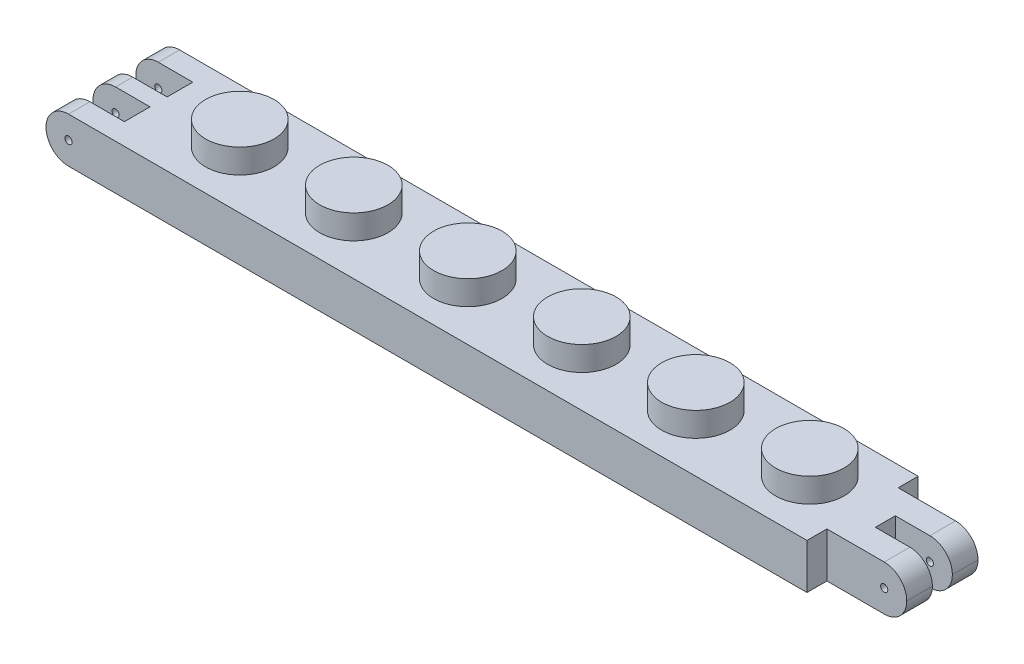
ISO-10303-21;
HEADER;
FILE_DESCRIPTION(('STEP AP214'),'2;1');
FILE_NAME('part.step','',(''),(''),'','','');
FILE_SCHEMA(('AUTOMOTIVE_DESIGN { 1 0 10303 214 1 1 1 1 }'));
ENDSEC;
DATA;
#1=APPLICATION_CONTEXT('core data for automotive mechanical design processes');
#2=APPLICATION_PROTOCOL_DEFINITION('international standard','automotive_design',2000,#1);
#3=PRODUCT_CONTEXT('',#1,'mechanical');
#4=PRODUCT('Part','Part','',(#3));
#5=PRODUCT_RELATED_PRODUCT_CATEGORY('part','',(#4));
#6=PRODUCT_DEFINITION_FORMATION('','',#4);
#7=PRODUCT_DEFINITION_CONTEXT('part definition',#1,'design');
#8=PRODUCT_DEFINITION('design','',#6,#7);
#9=PRODUCT_DEFINITION_SHAPE('','',#8);
#10=(LENGTH_UNIT() NAMED_UNIT(*) SI_UNIT(.MILLI.,.METRE.));
#11=(NAMED_UNIT(*) PLANE_ANGLE_UNIT() SI_UNIT($,.RADIAN.));
#12=(NAMED_UNIT(*) SI_UNIT($,.STERADIAN.) SOLID_ANGLE_UNIT());
#13=UNCERTAINTY_MEASURE_WITH_UNIT(LENGTH_MEASURE(1.E-05),#10,'distance_accuracy_value','');
#14=(GEOMETRIC_REPRESENTATION_CONTEXT(3) GLOBAL_UNCERTAINTY_ASSIGNED_CONTEXT((#13)) GLOBAL_UNIT_ASSIGNED_CONTEXT((#10,
#11,#12)) REPRESENTATION_CONTEXT('',''));
#15=CARTESIAN_POINT('',(0.,0.,0.));
#16=DIRECTION('',(0.,0.,1.));
#17=DIRECTION('',(1.,0.,0.));
#18=AXIS2_PLACEMENT_3D('',#15,#16,#17);
#19=CARTESIAN_POINT('',(-5.6,0.,-7.8));
#20=DIRECTION('',(-1.,0.,0.));
#21=DIRECTION('',(0.,0.,1.));
#22=AXIS2_PLACEMENT_3D('',#19,#20,#21);
#23=PLANE('',#22);
#24=DIRECTION('',(0.,-1.,0.));
#25=VECTOR('',#24,1.);
#26=CARTESIAN_POINT('',(-5.6,0.,-3.3));
#27=LINE('',#26,#25);
#28=CARTESIAN_POINT('',(-5.6,1.586,-3.3));
#29=VERTEX_POINT('',#28);
#30=CARTESIAN_POINT('',(-5.6,1.58,-3.3));
#31=VERTEX_POINT('',#30);
#32=EDGE_CURVE('E537',#29,#31,#27,.T.);
#33=ORIENTED_EDGE('',*,*,#32,.F.);
#34=DIRECTION('',(0.,0.,-1.));
#35=VECTOR('',#34,1.);
#36=CARTESIAN_POINT('',(-5.6,1.586,-4.5));
#37=LINE('',#36,#35);
#38=CARTESIAN_POINT('',(-5.6,1.586,-4.5));
#39=VERTEX_POINT('',#38);
#40=EDGE_CURVE('E569',#29,#39,#37,.T.);
#41=ORIENTED_EDGE('',*,*,#40,.T.);
#42=DIRECTION('',(0.,1.,0.));
#43=VECTOR('',#42,1.);
#44=CARTESIAN_POINT('',(-5.6,0.,-4.5));
#45=LINE('',#44,#43);
#46=CARTESIAN_POINT('',(-5.6,1.58,-4.5));
#47=VERTEX_POINT('',#46);
#48=EDGE_CURVE('E525',#47,#39,#45,.T.);
#49=ORIENTED_EDGE('',*,*,#48,.F.);
#50=DIRECTION('',(0.,0.,1.));
#51=VECTOR('',#50,1.);
#52=CARTESIAN_POINT('',(-5.6,1.58,-7.8));
#53=LINE('',#52,#51);
#54=EDGE_CURVE('E566',#47,#31,#53,.T.);
#55=ORIENTED_EDGE('',*,*,#54,.T.);
#56=EDGE_LOOP('',(#33,#41,#49,#55));
#57=FACE_BOUND('',#56,.T.);
#58=ADVANCED_FACE('F37',(#57),#23,.T.);
#59=DIRECTION('',(0.,-1.,0.));
#60=VECTOR('',#59,1.);
#61=CARTESIAN_POINT('',(-5.6,3.166,-7.8));
#62=LINE('',#61,#60);
#63=CARTESIAN_POINT('',(-5.6,1.586,-7.8));
#64=VERTEX_POINT('',#63);
#65=CARTESIAN_POINT('',(-5.6,1.58,-7.8));
#66=VERTEX_POINT('',#65);
#67=EDGE_CURVE('E433',#64,#66,#62,.T.);
#68=ORIENTED_EDGE('',*,*,#67,.T.);
#69=DIRECTION('',(0.,0.,1.));
#70=VECTOR('',#69,1.);
#71=CARTESIAN_POINT('',(-5.6,1.58,-7.8));
#72=LINE('',#71,#70);
#73=CARTESIAN_POINT('',(-5.6,1.58,-6.3));
#74=VERTEX_POINT('',#73);
#75=EDGE_CURVE('E582',#66,#74,#72,.T.);
#76=ORIENTED_EDGE('',*,*,#75,.T.);
#77=DIRECTION('',(0.,-1.,0.));
#78=VECTOR('',#77,1.);
#79=CARTESIAN_POINT('',(-5.6,0.,-6.3));
#80=LINE('',#79,#78);
#81=CARTESIAN_POINT('',(-5.6,1.586,-6.3));
#82=VERTEX_POINT('',#81);
#83=EDGE_CURVE('E530',#82,#74,#80,.T.);
#84=ORIENTED_EDGE('',*,*,#83,.F.);
#85=DIRECTION('',(0.,0.,-1.));
#86=VECTOR('',#85,1.);
#87=CARTESIAN_POINT('',(-5.6,1.586,-7.8));
#88=LINE('',#87,#86);
#89=EDGE_CURVE('E580',#82,#64,#88,.T.);
#90=ORIENTED_EDGE('',*,*,#89,.T.);
#91=EDGE_LOOP('',(#68,#76,#84,#90));
#92=FACE_BOUND('',#91,.T.);
#93=ADVANCED_FACE('F606',(#92),#23,.T.);
#94=CARTESIAN_POINT('',(53.4,0.,-1.4));
#95=DIRECTION('',(1.,0.,0.));
#96=DIRECTION('',(0.,0.,-1.));
#97=AXIS2_PLACEMENT_3D('',#94,#95,#96);
#98=PLANE('',#97);
#99=DIRECTION('',(0.,-1.,0.));
#100=VECTOR('',#99,1.);
#101=CARTESIAN_POINT('',(53.4,3.166,-1.4));
#102=LINE('',#101,#100);
#103=CARTESIAN_POINT('',(53.4,1.586,-1.4));
#104=VERTEX_POINT('',#103);
#105=CARTESIAN_POINT('',(53.4,1.58,-1.4));
#106=VERTEX_POINT('',#105);
#107=EDGE_CURVE('E479',#104,#106,#102,.T.);
#108=ORIENTED_EDGE('',*,*,#107,.T.);
#109=DIRECTION('',(0.,0.,-1.));
#110=VECTOR('',#109,1.);
#111=CARTESIAN_POINT('',(53.4,1.58,-1.4));
#112=LINE('',#111,#110);
#113=CARTESIAN_POINT('',(53.4,1.58,-3.2));
#114=VERTEX_POINT('',#113);
#115=EDGE_CURVE('E514',#106,#114,#112,.T.);
#116=ORIENTED_EDGE('',*,*,#115,.T.);
#117=DIRECTION('',(0.,-1.,0.));
#118=VECTOR('',#117,1.);
#119=CARTESIAN_POINT('',(53.4,3.166,-3.2));
#120=LINE('',#119,#118);
#121=CARTESIAN_POINT('',(53.4,1.586,-3.2));
#122=VERTEX_POINT('',#121);
#123=EDGE_CURVE('E448',#122,#114,#120,.T.);
#124=ORIENTED_EDGE('',*,*,#123,.F.);
#125=DIRECTION('',(0.,0.,1.));
#126=VECTOR('',#125,1.);
#127=CARTESIAN_POINT('',(53.4,1.586,-1.4));
#128=LINE('',#127,#126);
#129=EDGE_CURVE('E511',#122,#104,#128,.T.);
#130=ORIENTED_EDGE('',*,*,#129,.T.);
#131=EDGE_LOOP('',(#108,#116,#124,#130));
#132=FACE_BOUND('',#131,.T.);
#133=ADVANCED_FACE('F914',(#132),#98,.T.);
#134=CARTESIAN_POINT('',(47.8,3.166,0.));
#135=DIRECTION('',(-1.,0.,0.));
#136=DIRECTION('',(0.,0.,1.));
#137=AXIS2_PLACEMENT_3D('',#134,#135,#136);
#138=PLANE('',#137);
#139=DIRECTION('',(0.,-1.,0.));
#140=VECTOR('',#139,1.);
#141=CARTESIAN_POINT('',(47.8,3.166,-1.4));
#142=LINE('',#141,#140);
#143=CARTESIAN_POINT('',(47.8,3.166,-1.4));
#144=VERTEX_POINT('',#143);
#145=CARTESIAN_POINT('',(47.8,0.,-1.4));
#146=VERTEX_POINT('',#145);
#147=EDGE_CURVE('E470',#144,#146,#142,.T.);
#148=ORIENTED_EDGE('',*,*,#147,.F.);
#149=DIRECTION('',(0.,0.,-1.));
#150=VECTOR('',#149,1.);
#151=CARTESIAN_POINT('',(47.8,3.166,0.));
#152=LINE('',#151,#150);
#153=CARTESIAN_POINT('',(47.8,3.166,0.));
#154=VERTEX_POINT('',#153);
#155=EDGE_CURVE('E599',#154,#144,#152,.T.);
#156=ORIENTED_EDGE('',*,*,#155,.F.);
#157=DIRECTION('',(0.,-1.,0.));
#158=VECTOR('',#157,1.);
#159=CARTESIAN_POINT('',(47.8,3.166,0.));
#160=LINE('',#159,#158);
#161=CARTESIAN_POINT('',(47.8,0.,0.));
#162=VERTEX_POINT('',#161);
#163=EDGE_CURVE('E667',#154,#162,#160,.T.);
#164=ORIENTED_EDGE('',*,*,#163,.T.);
#165=DIRECTION('',(0.,0.,-1.));
#166=VECTOR('',#165,1.);
#167=CARTESIAN_POINT('',(47.8,0.,0.));
#168=LINE('',#167,#166);
#169=EDGE_CURVE('E693',#162,#146,#168,.T.);
#170=ORIENTED_EDGE('',*,*,#169,.T.);
#171=EDGE_LOOP('',(#148,#156,#164,#170));
#172=FACE_BOUND('',#171,.T.);
#173=ADVANCED_FACE('F675',(#172),#138,.F.);
#174=DIRECTION('',(0.,1.,0.));
#175=VECTOR('',#174,1.);
#176=CARTESIAN_POINT('',(47.8,3.166,-6.4));
#177=LINE('',#176,#175);
#178=CARTESIAN_POINT('',(47.8,0.,-6.4));
#179=VERTEX_POINT('',#178);
#180=CARTESIAN_POINT('',(47.8,3.166,-6.4));
#181=VERTEX_POINT('',#180);
#182=EDGE_CURVE('E483',#179,#181,#177,.T.);
#183=ORIENTED_EDGE('',*,*,#182,.F.);
#184=CARTESIAN_POINT('',(47.8,0.,-7.8));
#185=VERTEX_POINT('',#184);
#186=EDGE_CURVE('E680',#179,#185,#168,.T.);
#187=ORIENTED_EDGE('',*,*,#186,.T.);
#188=DIRECTION('',(0.,-1.,0.));
#189=VECTOR('',#188,1.);
#190=CARTESIAN_POINT('',(47.8,3.166,-7.8));
#191=LINE('',#190,#189);
#192=CARTESIAN_POINT('',(47.8,3.166,-7.8));
#193=VERTEX_POINT('',#192);
#194=EDGE_CURVE('E598',#193,#185,#191,.T.);
#195=ORIENTED_EDGE('',*,*,#194,.F.);
#196=EDGE_CURVE('E596',#181,#193,#152,.T.);
#197=ORIENTED_EDGE('',*,*,#196,.F.);
#198=EDGE_LOOP('',(#183,#187,#195,#197));
#199=FACE_BOUND('',#198,.T.);
#200=ADVANCED_FACE('F857',(#199),#138,.F.);
#201=CARTESIAN_POINT('',(0.,3.166,-7.8));
#202=DIRECTION('',(0.,-1.,0.));
#203=DIRECTION('',(0.,0.,-1.));
#204=AXIS2_PLACEMENT_3D('',#201,#202,#203);
#205=PLANE('',#204);
#206=DIRECTION('',(1.,0.,0.));
#207=VECTOR('',#206,1.);
#208=CARTESIAN_POINT('',(-5.6,3.166,-1.5));
#209=LINE('',#208,#207);
#210=CARTESIAN_POINT('',(-4.02,3.166,-1.5));
#211=VERTEX_POINT('',#210);
#212=CARTESIAN_POINT('',(-1.6,3.166,-1.5));
#213=VERTEX_POINT('',#212);
#214=EDGE_CURVE('E379',#211,#213,#209,.T.);
#215=ORIENTED_EDGE('',*,*,#214,.F.);
#216=DIRECTION('',(0.,0.,-1.));
#217=VECTOR('',#216,1.);
#218=CARTESIAN_POINT('',(-4.02,3.166,0.));
#219=LINE('',#218,#217);
#220=CARTESIAN_POINT('',(-4.02,3.166,0.));
#221=VERTEX_POINT('',#220);
#222=EDGE_CURVE('E564',#211,#221,#219,.F.);
#223=ORIENTED_EDGE('',*,*,#222,.T.);
#224=DIRECTION('',(1.,0.,0.));
#225=VECTOR('',#224,1.);
#226=CARTESIAN_POINT('',(0.,3.166,0.));
#227=LINE('',#226,#225);
#228=EDGE_CURVE('E658',#221,#154,#227,.T.);
#229=ORIENTED_EDGE('',*,*,#228,.T.);
#230=ORIENTED_EDGE('',*,*,#155,.T.);
#231=DIRECTION('',(-1.,0.,0.));
#232=VECTOR('',#231,1.);
#233=CARTESIAN_POINT('',(53.4,3.166,-1.4));
#234=LINE('',#233,#232);
#235=CARTESIAN_POINT('',(51.82,3.166,-1.4));
#236=VERTEX_POINT('',#235);
#237=EDGE_CURVE('E486',#236,#144,#234,.T.);
#238=ORIENTED_EDGE('',*,*,#237,.F.);
#239=DIRECTION('',(0.,0.,1.));
#240=VECTOR('',#239,1.);
#241=CARTESIAN_POINT('',(51.82,3.166,-3.2));
#242=LINE('',#241,#240);
#243=CARTESIAN_POINT('',(51.82,3.166,-3.2));
#244=VERTEX_POINT('',#243);
#245=EDGE_CURVE('E507',#236,#244,#242,.F.);
#246=ORIENTED_EDGE('',*,*,#245,.T.);
#247=DIRECTION('',(1.,0.,0.));
#248=VECTOR('',#247,1.);
#249=CARTESIAN_POINT('',(49.4,3.166,-3.2));
#250=LINE('',#249,#248);
#251=CARTESIAN_POINT('',(49.4,3.166,-3.2));
#252=VERTEX_POINT('',#251);
#253=EDGE_CURVE('E467',#252,#244,#250,.T.);
#254=ORIENTED_EDGE('',*,*,#253,.F.);
#255=DIRECTION('',(0.,0.,1.));
#256=VECTOR('',#255,1.);
#257=CARTESIAN_POINT('',(49.4,3.166,-3.2));
#258=LINE('',#257,#256);
#259=CARTESIAN_POINT('',(49.4,3.166,-4.6));
#260=VERTEX_POINT('',#259);
#261=EDGE_CURVE('E459',#260,#252,#258,.T.);
#262=ORIENTED_EDGE('',*,*,#261,.F.);
#263=DIRECTION('',(1.,0.,0.));
#264=VECTOR('',#263,1.);
#265=CARTESIAN_POINT('',(49.4,3.166,-4.6));
#266=LINE('',#265,#264);
#267=CARTESIAN_POINT('',(51.82,3.166,-4.6));
#268=VERTEX_POINT('',#267);
#269=EDGE_CURVE('E471',#260,#268,#266,.T.);
#270=ORIENTED_EDGE('',*,*,#269,.T.);
#271=DIRECTION('',(0.,0.,1.));
#272=VECTOR('',#271,1.);
#273=CARTESIAN_POINT('',(51.82,3.166,-6.4));
#274=LINE('',#273,#272);
#275=CARTESIAN_POINT('',(51.82,3.166,-6.4));
#276=VERTEX_POINT('',#275);
#277=EDGE_CURVE('E509',#268,#276,#274,.F.);
#278=ORIENTED_EDGE('',*,*,#277,.T.);
#279=DIRECTION('',(-1.,0.,0.));
#280=VECTOR('',#279,1.);
#281=CARTESIAN_POINT('',(53.4,3.166,-6.4));
#282=LINE('',#281,#280);
#283=EDGE_CURVE('E504',#276,#181,#282,.T.);
#284=ORIENTED_EDGE('',*,*,#283,.T.);
#285=ORIENTED_EDGE('',*,*,#196,.T.);
#286=DIRECTION('',(-1.,0.,0.));
#287=VECTOR('',#286,1.);
#288=CARTESIAN_POINT('',(0.,3.166,-7.8));
#289=LINE('',#288,#287);
#290=CARTESIAN_POINT('',(-4.02,3.166,-7.8));
#291=VERTEX_POINT('',#290);
#292=EDGE_CURVE('E593',#193,#291,#289,.T.);
#293=ORIENTED_EDGE('',*,*,#292,.T.);
#294=DIRECTION('',(0.,0.,-1.));
#295=VECTOR('',#294,1.);
#296=CARTESIAN_POINT('',(-4.02,3.166,-6.3));
#297=LINE('',#296,#295);
#298=CARTESIAN_POINT('',(-4.02,3.166,-6.3));
#299=VERTEX_POINT('',#298);
#300=EDGE_CURVE('E560',#291,#299,#297,.F.);
#301=ORIENTED_EDGE('',*,*,#300,.T.);
#302=DIRECTION('',(-1.,0.,0.));
#303=VECTOR('',#302,1.);
#304=CARTESIAN_POINT('',(-5.6,3.166,-6.3));
#305=LINE('',#304,#303);
#306=CARTESIAN_POINT('',(-1.6,3.166,-6.3));
#307=VERTEX_POINT('',#306);
#308=EDGE_CURVE('E420',#307,#299,#305,.T.);
#309=ORIENTED_EDGE('',*,*,#308,.F.);
#310=DIRECTION('',(0.,0.,-1.));
#311=VECTOR('',#310,1.);
#312=CARTESIAN_POINT('',(-1.6,3.166,-6.3));
#313=LINE('',#312,#311);
#314=CARTESIAN_POINT('',(-1.6,3.166,-4.5));
#315=VERTEX_POINT('',#314);
#316=EDGE_CURVE('E417',#315,#307,#313,.T.);
#317=ORIENTED_EDGE('',*,*,#316,.F.);
#318=DIRECTION('',(1.,0.,0.));
#319=VECTOR('',#318,1.);
#320=CARTESIAN_POINT('',(-5.6,3.166,-4.5));
#321=LINE('',#320,#319);
#322=CARTESIAN_POINT('',(-4.02,3.166,-4.5));
#323=VERTEX_POINT('',#322);
#324=EDGE_CURVE('E415',#323,#315,#321,.T.);
#325=ORIENTED_EDGE('',*,*,#324,.F.);
#326=DIRECTION('',(0.,0.,-1.));
#327=VECTOR('',#326,1.);
#328=CARTESIAN_POINT('',(-4.02,3.166,-3.3));
#329=LINE('',#328,#327);
#330=CARTESIAN_POINT('',(-4.02,3.166,-3.3));
#331=VERTEX_POINT('',#330);
#332=EDGE_CURVE('E562',#323,#331,#329,.F.);
#333=ORIENTED_EDGE('',*,*,#332,.T.);
#334=DIRECTION('',(-1.,0.,0.));
#335=VECTOR('',#334,1.);
#336=CARTESIAN_POINT('',(-5.6,3.166,-3.3));
#337=LINE('',#336,#335);
#338=CARTESIAN_POINT('',(-1.6,3.166,-3.3));
#339=VERTEX_POINT('',#338);
#340=EDGE_CURVE('E401',#339,#331,#337,.T.);
#341=ORIENTED_EDGE('',*,*,#340,.F.);
#342=DIRECTION('',(0.,0.,-1.));
#343=VECTOR('',#342,1.);
#344=CARTESIAN_POINT('',(-1.6,3.166,-3.3));
#345=LINE('',#344,#343);
#346=EDGE_CURVE('E390',#213,#339,#345,.T.);
#347=ORIENTED_EDGE('',*,*,#346,.F.);
#348=EDGE_LOOP('',(#215,#223,#229,#230,#238,#246,#254,#262,#270,#278,#284,#285,#293,#301,#309,
#317,#325,#333,#341,#347));
#349=FACE_BOUND('',#348,.T.);
#350=CARTESIAN_POINT('',(36.,3.166,-4.));
#351=DIRECTION('',(0.,-1.,0.));
#352=DIRECTION('',(0.,0.,-1.));
#353=AXIS2_PLACEMENT_3D('',#350,#351,#352);
#354=CIRCLE('',#353,2.4);
#355=CARTESIAN_POINT('',(36.,3.166,-6.4));
#356=VERTEX_POINT('',#355);
#357=EDGE_CURVE('E838',#356,#356,#354,.F.);
#358=ORIENTED_EDGE('',*,*,#357,.F.);
#359=EDGE_LOOP('',(#358));
#360=FACE_BOUND('',#359,.T.);
#361=CARTESIAN_POINT('',(20.,3.166,-4.));
#362=DIRECTION('',(0.,-1.,0.));
#363=DIRECTION('',(0.,0.,-1.));
#364=AXIS2_PLACEMENT_3D('',#361,#362,#363);
#365=CIRCLE('',#364,2.4);
#366=CARTESIAN_POINT('',(20.,3.166,-6.4));
#367=VERTEX_POINT('',#366);
#368=EDGE_CURVE('E844',#367,#367,#365,.F.);
#369=ORIENTED_EDGE('',*,*,#368,.F.);
#370=EDGE_LOOP('',(#369));
#371=FACE_BOUND('',#370,.T.);
#372=CARTESIAN_POINT('',(4.,3.166,-4.));
#373=DIRECTION('',(0.,-1.,0.));
#374=DIRECTION('',(0.,0.,-1.));
#375=AXIS2_PLACEMENT_3D('',#372,#373,#374);
#376=CIRCLE('',#375,2.4);
#377=CARTESIAN_POINT('',(4.,3.166,-6.4));
#378=VERTEX_POINT('',#377);
#379=EDGE_CURVE('E672',#378,#378,#376,.F.);
#380=ORIENTED_EDGE('',*,*,#379,.F.);
#381=EDGE_LOOP('',(#380));
#382=FACE_BOUND('',#381,.T.);
#383=CARTESIAN_POINT('',(12.,3.166,-4.));
#384=DIRECTION('',(0.,-1.,0.));
#385=DIRECTION('',(0.,0.,-1.));
#386=AXIS2_PLACEMENT_3D('',#383,#384,#385);
#387=CIRCLE('',#386,2.4);
#388=CARTESIAN_POINT('',(12.,3.166,-6.4));
#389=VERTEX_POINT('',#388);
#390=EDGE_CURVE('E847',#389,#389,#387,.F.);
#391=ORIENTED_EDGE('',*,*,#390,.F.);
#392=EDGE_LOOP('',(#391));
#393=FACE_BOUND('',#392,.T.);
#394=CARTESIAN_POINT('',(28.,3.166,-4.));
#395=DIRECTION('',(0.,-1.,0.));
#396=DIRECTION('',(0.,0.,-1.));
#397=AXIS2_PLACEMENT_3D('',#394,#395,#396);
#398=CIRCLE('',#397,2.4);
#399=CARTESIAN_POINT('',(28.,3.166,-6.4));
#400=VERTEX_POINT('',#399);
#401=EDGE_CURVE('E841',#400,#400,#398,.F.);
#402=ORIENTED_EDGE('',*,*,#401,.F.);
#403=EDGE_LOOP('',(#402));
#404=FACE_BOUND('',#403,.T.);
#405=CARTESIAN_POINT('',(44.,3.166,-4.));
#406=DIRECTION('',(0.,-1.,0.));
#407=DIRECTION('',(0.,0.,-1.));
#408=AXIS2_PLACEMENT_3D('',#405,#406,#407);
#409=CIRCLE('',#408,2.4);
#410=CARTESIAN_POINT('',(44.,3.166,-6.4));
#411=VERTEX_POINT('',#410);
#412=EDGE_CURVE('E835',#411,#411,#409,.F.);
#413=ORIENTED_EDGE('',*,*,#412,.F.);
#414=EDGE_LOOP('',(#413));
#415=FACE_BOUND('',#414,.T.);
#416=ADVANCED_FACE('F403',(#349,#360,#371,#382,#393,#404,#415),#205,.F.);
#417=CARTESIAN_POINT('',(0.,3.166,0.));
#418=DIRECTION('',(0.,0.,-1.));
#419=DIRECTION('',(-1.,0.,0.));
#420=AXIS2_PLACEMENT_3D('',#417,#418,#419);
#421=PLANE('',#420);
#422=CARTESIAN_POINT('',(-4.02,1.58,0.));
#423=DIRECTION('',(0.,0.,-1.));
#424=DIRECTION('',(-1.,0.,0.));
#425=AXIS2_PLACEMENT_3D('',#422,#423,#424);
#426=CIRCLE('',#425,0.25);
#427=CARTESIAN_POINT('',(-4.27,1.58,0.));
#428=VERTEX_POINT('',#427);
#429=EDGE_CURVE('E391',#428,#428,#426,.T.);
#430=ORIENTED_EDGE('',*,*,#429,.T.);
#431=EDGE_LOOP('',(#430));
#432=FACE_BOUND('',#431,.T.);
#433=DIRECTION('',(0.,1.,0.));
#434=VECTOR('',#433,1.);
#435=CARTESIAN_POINT('',(-5.6,3.166,0.));
#436=LINE('',#435,#434);
#437=CARTESIAN_POINT('',(-5.6,1.58,0.));
#438=VERTEX_POINT('',#437);
#439=CARTESIAN_POINT('',(-5.6,1.586,0.));
#440=VERTEX_POINT('',#439);
#441=EDGE_CURVE('E435',#438,#440,#436,.T.);
#442=ORIENTED_EDGE('',*,*,#441,.F.);
#443=CARTESIAN_POINT('',(-4.02,1.58,0.));
#444=DIRECTION('',(0.,0.,-1.));
#445=DIRECTION('',(-1.,0.,0.));
#446=AXIS2_PLACEMENT_3D('',#443,#444,#445);
#447=CIRCLE('',#446,1.58);
#448=CARTESIAN_POINT('',(-4.02,0.,0.));
#449=VERTEX_POINT('',#448);
#450=EDGE_CURVE('E549',#438,#449,#447,.F.);
#451=ORIENTED_EDGE('',*,*,#450,.T.);
#452=DIRECTION('',(1.,0.,0.));
#453=VECTOR('',#452,1.);
#454=CARTESIAN_POINT('',(0.,0.,0.));
#455=LINE('',#454,#453);
#456=EDGE_CURVE('E668',#449,#162,#455,.T.);
#457=ORIENTED_EDGE('',*,*,#456,.T.);
#458=ORIENTED_EDGE('',*,*,#163,.F.);
#459=ORIENTED_EDGE('',*,*,#228,.F.);
#460=CARTESIAN_POINT('',(-4.02,1.586,0.));
#461=DIRECTION('',(0.,0.,-1.));
#462=DIRECTION('',(-1.,0.,0.));
#463=AXIS2_PLACEMENT_3D('',#460,#461,#462);
#464=CIRCLE('',#463,1.58);
#465=EDGE_CURVE('E547',#221,#440,#464,.F.);
#466=ORIENTED_EDGE('',*,*,#465,.T.);
#467=EDGE_LOOP('',(#442,#451,#457,#458,#459,#466));
#468=FACE_BOUND('',#467,.T.);
#469=ADVANCED_FACE('F654',(#432,#468),#421,.F.);
#470=CARTESIAN_POINT('',(0.,3.166,-7.8));
#471=DIRECTION('',(0.,0.,1.));
#472=DIRECTION('',(1.,0.,0.));
#473=AXIS2_PLACEMENT_3D('',#470,#471,#472);
#474=PLANE('',#473);
#475=CARTESIAN_POINT('',(-4.02,1.58,-7.8));
#476=DIRECTION('',(0.,0.,-1.));
#477=DIRECTION('',(-1.,0.,0.));
#478=AXIS2_PLACEMENT_3D('',#475,#476,#477);
#479=CIRCLE('',#478,0.25);
#480=CARTESIAN_POINT('',(-4.27,1.58,-7.8));
#481=VERTEX_POINT('',#480);
#482=EDGE_CURVE('E1006',#481,#481,#479,.T.);
#483=ORIENTED_EDGE('',*,*,#482,.F.);
#484=EDGE_LOOP('',(#483));
#485=FACE_BOUND('',#484,.T.);
#486=DIRECTION('',(-1.,0.,0.));
#487=VECTOR('',#486,1.);
#488=CARTESIAN_POINT('',(0.,0.,-7.8));
#489=LINE('',#488,#487);
#490=CARTESIAN_POINT('',(-4.02,0.,-7.8));
#491=VERTEX_POINT('',#490);
#492=EDGE_CURVE('E664',#185,#491,#489,.T.);
#493=ORIENTED_EDGE('',*,*,#492,.T.);
#494=CARTESIAN_POINT('',(-4.02,1.58,-7.8));
#495=DIRECTION('',(0.,0.,1.));
#496=DIRECTION('',(1.,0.,0.));
#497=AXIS2_PLACEMENT_3D('',#494,#495,#496);
#498=CIRCLE('',#497,1.58);
#499=EDGE_CURVE('E11',#491,#66,#498,.F.);
#500=ORIENTED_EDGE('',*,*,#499,.T.);
#501=ORIENTED_EDGE('',*,*,#67,.F.);
#502=CARTESIAN_POINT('',(-4.02,1.586,-7.8));
#503=DIRECTION('',(0.,0.,1.));
#504=DIRECTION('',(1.,0.,0.));
#505=AXIS2_PLACEMENT_3D('',#502,#503,#504);
#506=CIRCLE('',#505,1.58);
#507=EDGE_CURVE('E46',#64,#291,#506,.F.);
#508=ORIENTED_EDGE('',*,*,#507,.T.);
#509=ORIENTED_EDGE('',*,*,#292,.F.);
#510=ORIENTED_EDGE('',*,*,#194,.T.);
#511=EDGE_LOOP('',(#493,#500,#501,#508,#509,#510));
#512=FACE_BOUND('',#511,.T.);
#513=ADVANCED_FACE('F591',(#485,#512),#474,.F.);
#514=CARTESIAN_POINT('',(0.,0.,-7.8));
#515=DIRECTION('',(0.,-1.,0.));
#516=DIRECTION('',(0.,0.,-1.));
#517=AXIS2_PLACEMENT_3D('',#514,#515,#516);
#518=PLANE('',#517);
#519=ORIENTED_EDGE('',*,*,#456,.F.);
#520=DIRECTION('',(0.,0.,1.));
#521=VECTOR('',#520,1.);
#522=CARTESIAN_POINT('',(-4.02,0.,-7.8));
#523=LINE('',#522,#521);
#524=CARTESIAN_POINT('',(-4.02,0.,-1.5));
#525=VERTEX_POINT('',#524);
#526=EDGE_CURVE('E555',#449,#525,#523,.F.);
#527=ORIENTED_EDGE('',*,*,#526,.T.);
#528=DIRECTION('',(-1.,0.,0.));
#529=VECTOR('',#528,1.);
#530=CARTESIAN_POINT('',(0.,0.,-1.5));
#531=LINE('',#530,#529);
#532=CARTESIAN_POINT('',(-1.6,0.,-1.5));
#533=VERTEX_POINT('',#532);
#534=EDGE_CURVE('E410',#533,#525,#531,.T.);
#535=ORIENTED_EDGE('',*,*,#534,.F.);
#536=DIRECTION('',(0.,0.,1.));
#537=VECTOR('',#536,1.);
#538=CARTESIAN_POINT('',(-1.6,0.,-7.8));
#539=LINE('',#538,#537);
#540=CARTESIAN_POINT('',(-1.6,0.,-3.3));
#541=VERTEX_POINT('',#540);
#542=EDGE_CURVE('E399',#541,#533,#539,.T.);
#543=ORIENTED_EDGE('',*,*,#542,.F.);
#544=DIRECTION('',(1.,0.,0.));
#545=VECTOR('',#544,1.);
#546=CARTESIAN_POINT('',(0.,0.,-3.3));
#547=LINE('',#546,#545);
#548=CARTESIAN_POINT('',(-4.02,0.,-3.3));
#549=VERTEX_POINT('',#548);
#550=EDGE_CURVE('E413',#549,#541,#547,.T.);
#551=ORIENTED_EDGE('',*,*,#550,.F.);
#552=DIRECTION('',(0.,0.,1.));
#553=VECTOR('',#552,1.);
#554=CARTESIAN_POINT('',(-4.02,0.,-7.8));
#555=LINE('',#554,#553);
#556=CARTESIAN_POINT('',(-4.02,0.,-4.5));
#557=VERTEX_POINT('',#556);
#558=EDGE_CURVE('E553',#549,#557,#555,.F.);
#559=ORIENTED_EDGE('',*,*,#558,.T.);
#560=DIRECTION('',(-1.,0.,0.));
#561=VECTOR('',#560,1.);
#562=CARTESIAN_POINT('',(0.,0.,-4.5));
#563=LINE('',#562,#561);
#564=CARTESIAN_POINT('',(-1.6,0.,-4.5));
#565=VERTEX_POINT('',#564);
#566=EDGE_CURVE('E426',#565,#557,#563,.T.);
#567=ORIENTED_EDGE('',*,*,#566,.F.);
#568=DIRECTION('',(0.,0.,1.));
#569=VECTOR('',#568,1.);
#570=CARTESIAN_POINT('',(-1.6,0.,-7.8));
#571=LINE('',#570,#569);
#572=CARTESIAN_POINT('',(-1.6,0.,-6.3));
#573=VERTEX_POINT('',#572);
#574=EDGE_CURVE('E533',#573,#565,#571,.T.);
#575=ORIENTED_EDGE('',*,*,#574,.F.);
#576=DIRECTION('',(1.,0.,0.));
#577=VECTOR('',#576,1.);
#578=CARTESIAN_POINT('',(0.,0.,-6.3));
#579=LINE('',#578,#577);
#580=CARTESIAN_POINT('',(-4.02,0.,-6.3));
#581=VERTEX_POINT('',#580);
#582=EDGE_CURVE('E431',#581,#573,#579,.T.);
#583=ORIENTED_EDGE('',*,*,#582,.F.);
#584=DIRECTION('',(0.,0.,1.));
#585=VECTOR('',#584,1.);
#586=CARTESIAN_POINT('',(-4.02,0.,-7.8));
#587=LINE('',#586,#585);
#588=EDGE_CURVE('E551',#581,#491,#587,.F.);
#589=ORIENTED_EDGE('',*,*,#588,.T.);
#590=ORIENTED_EDGE('',*,*,#492,.F.);
#591=ORIENTED_EDGE('',*,*,#186,.F.);
#592=DIRECTION('',(-1.,0.,0.));
#593=VECTOR('',#592,1.);
#594=CARTESIAN_POINT('',(53.4,0.,-6.4));
#595=LINE('',#594,#593);
#596=CARTESIAN_POINT('',(51.82,0.,-6.4));
#597=VERTEX_POINT('',#596);
#598=EDGE_CURVE('E854',#597,#179,#595,.T.);
#599=ORIENTED_EDGE('',*,*,#598,.F.);
#600=DIRECTION('',(0.,0.,-1.));
#601=VECTOR('',#600,1.);
#602=CARTESIAN_POINT('',(51.82,0.,-7.8));
#603=LINE('',#602,#601);
#604=CARTESIAN_POINT('',(51.82,0.,-4.6));
#605=VERTEX_POINT('',#604);
#606=EDGE_CURVE('E877',#597,#605,#603,.F.);
#607=ORIENTED_EDGE('',*,*,#606,.T.);
#608=DIRECTION('',(1.,0.,0.));
#609=VECTOR('',#608,1.);
#610=CARTESIAN_POINT('',(49.4,0.,-4.6));
#611=LINE('',#610,#609);
#612=CARTESIAN_POINT('',(49.4,0.,-4.6));
#613=VERTEX_POINT('',#612);
#614=EDGE_CURVE('E474',#613,#605,#611,.T.);
#615=ORIENTED_EDGE('',*,*,#614,.F.);
#616=DIRECTION('',(0.,0.,-1.));
#617=VECTOR('',#616,1.);
#618=CARTESIAN_POINT('',(49.4,0.,-3.2));
#619=LINE('',#618,#617);
#620=CARTESIAN_POINT('',(49.4,0.,-3.2));
#621=VERTEX_POINT('',#620);
#622=EDGE_CURVE('E452',#621,#613,#619,.T.);
#623=ORIENTED_EDGE('',*,*,#622,.F.);
#624=DIRECTION('',(1.,0.,0.));
#625=VECTOR('',#624,1.);
#626=CARTESIAN_POINT('',(49.4,0.,-3.2));
#627=LINE('',#626,#625);
#628=CARTESIAN_POINT('',(51.82,0.,-3.2));
#629=VERTEX_POINT('',#628);
#630=EDGE_CURVE('E462',#621,#629,#627,.T.);
#631=ORIENTED_EDGE('',*,*,#630,.T.);
#632=DIRECTION('',(0.,0.,-1.));
#633=VECTOR('',#632,1.);
#634=CARTESIAN_POINT('',(51.82,0.,-7.8));
#635=LINE('',#634,#633);
#636=CARTESIAN_POINT('',(51.82,0.,-1.4));
#637=VERTEX_POINT('',#636);
#638=EDGE_CURVE('E873',#629,#637,#635,.F.);
#639=ORIENTED_EDGE('',*,*,#638,.T.);
#640=DIRECTION('',(-1.,0.,0.));
#641=VECTOR('',#640,1.);
#642=CARTESIAN_POINT('',(53.4,0.,-1.4));
#643=LINE('',#642,#641);
#644=EDGE_CURVE('E868',#637,#146,#643,.T.);
#645=ORIENTED_EDGE('',*,*,#644,.T.);
#646=ORIENTED_EDGE('',*,*,#169,.F.);
#647=EDGE_LOOP('',(#519,#527,#535,#543,#551,#559,#567,#575,#583,#589,#590,#591,#599,#607,#615,
#623,#631,#639,#645,#646));
#648=FACE_BOUND('',#647,.T.);
#649=DIRECTION('',(0.,0.,-1.));
#650=VECTOR('',#649,1.);
#651=CARTESIAN_POINT('',(33.55,0.,-1.55));
#652=LINE('',#651,#650);
#653=CARTESIAN_POINT('',(33.55,0.,-1.55));
#654=VERTEX_POINT('',#653);
#655=CARTESIAN_POINT('',(33.55,0.,-6.35));
#656=VERTEX_POINT('',#655);
#657=EDGE_CURVE('E1721',#654,#656,#652,.T.);
#658=ORIENTED_EDGE('',*,*,#657,.F.);
#659=DIRECTION('',(-1.,0.,0.));
#660=VECTOR('',#659,1.);
#661=CARTESIAN_POINT('',(33.55,0.,-1.55));
#662=LINE('',#661,#660);
#663=CARTESIAN_POINT('',(38.35,0.,-1.55));
#664=VERTEX_POINT('',#663);
#665=EDGE_CURVE('E1731',#664,#654,#662,.T.);
#666=ORIENTED_EDGE('',*,*,#665,.F.);
#667=DIRECTION('',(0.,0.,1.));
#668=VECTOR('',#667,1.);
#669=CARTESIAN_POINT('',(38.35,0.,-1.55));
#670=LINE('',#669,#668);
#671=CARTESIAN_POINT('',(38.35,0.,-6.35));
#672=VERTEX_POINT('',#671);
#673=EDGE_CURVE('E1722',#672,#664,#670,.T.);
#674=ORIENTED_EDGE('',*,*,#673,.F.);
#675=DIRECTION('',(1.,0.,0.));
#676=VECTOR('',#675,1.);
#677=CARTESIAN_POINT('',(33.55,0.,-6.35));
#678=LINE('',#677,#676);
#679=EDGE_CURVE('E875',#656,#672,#678,.T.);
#680=ORIENTED_EDGE('',*,*,#679,.F.);
#681=EDGE_LOOP('',(#658,#666,#674,#680));
#682=FACE_BOUND('',#681,.T.);
#683=DIRECTION('',(0.,0.,-1.));
#684=VECTOR('',#683,1.);
#685=CARTESIAN_POINT('',(41.55,0.,-1.55));
#686=LINE('',#685,#684);
#687=CARTESIAN_POINT('',(41.55,0.,-1.55));
#688=VERTEX_POINT('',#687);
#689=CARTESIAN_POINT('',(41.55,0.,-6.35));
#690=VERTEX_POINT('',#689);
#691=EDGE_CURVE('E1751',#688,#690,#686,.T.);
#692=ORIENTED_EDGE('',*,*,#691,.F.);
#693=DIRECTION('',(-1.,0.,0.));
#694=VECTOR('',#693,1.);
#695=CARTESIAN_POINT('',(41.55,0.,-1.55));
#696=LINE('',#695,#694);
#697=CARTESIAN_POINT('',(46.35,0.,-1.55));
#698=VERTEX_POINT('',#697);
#699=EDGE_CURVE('E1756',#698,#688,#696,.T.);
#700=ORIENTED_EDGE('',*,*,#699,.F.);
#701=DIRECTION('',(0.,0.,1.));
#702=VECTOR('',#701,1.);
#703=CARTESIAN_POINT('',(46.35,0.,-1.55));
#704=LINE('',#703,#702);
#705=CARTESIAN_POINT('',(46.35,0.,-6.35));
#706=VERTEX_POINT('',#705);
#707=EDGE_CURVE('E1770',#706,#698,#704,.T.);
#708=ORIENTED_EDGE('',*,*,#707,.F.);
#709=DIRECTION('',(1.,0.,0.));
#710=VECTOR('',#709,1.);
#711=CARTESIAN_POINT('',(41.55,0.,-6.35));
#712=LINE('',#711,#710);
#713=EDGE_CURVE('E1767',#690,#706,#712,.T.);
#714=ORIENTED_EDGE('',*,*,#713,.F.);
#715=EDGE_LOOP('',(#692,#700,#708,#714));
#716=FACE_BOUND('',#715,.T.);
#717=DIRECTION('',(0.,0.,-1.));
#718=VECTOR('',#717,1.);
#719=CARTESIAN_POINT('',(25.55,0.,-1.55));
#720=LINE('',#719,#718);
#721=CARTESIAN_POINT('',(25.55,0.,-1.55));
#722=VERTEX_POINT('',#721);
#723=CARTESIAN_POINT('',(25.55,0.,-6.35));
#724=VERTEX_POINT('',#723);
#725=EDGE_CURVE('E833',#722,#724,#720,.T.);
#726=ORIENTED_EDGE('',*,*,#725,.F.);
#727=DIRECTION('',(-1.,0.,0.));
#728=VECTOR('',#727,1.);
#729=CARTESIAN_POINT('',(25.55,0.,-1.55));
#730=LINE('',#729,#728);
#731=CARTESIAN_POINT('',(30.35,0.,-1.55));
#732=VERTEX_POINT('',#731);
#733=EDGE_CURVE('E830',#732,#722,#730,.T.);
#734=ORIENTED_EDGE('',*,*,#733,.F.);
#735=DIRECTION('',(0.,0.,1.));
#736=VECTOR('',#735,1.);
#737=CARTESIAN_POINT('',(30.35,0.,-1.55));
#738=LINE('',#737,#736);
#739=CARTESIAN_POINT('',(30.35,0.,-6.35));
#740=VERTEX_POINT('',#739);
#741=EDGE_CURVE('E827',#740,#732,#738,.T.);
#742=ORIENTED_EDGE('',*,*,#741,.F.);
#743=DIRECTION('',(1.,0.,0.));
#744=VECTOR('',#743,1.);
#745=CARTESIAN_POINT('',(25.55,0.,-6.35));
#746=LINE('',#745,#744);
#747=EDGE_CURVE('E824',#724,#740,#746,.T.);
#748=ORIENTED_EDGE('',*,*,#747,.F.);
#749=EDGE_LOOP('',(#726,#734,#742,#748));
#750=FACE_BOUND('',#749,.T.);
#751=DIRECTION('',(0.,0.,-1.));
#752=VECTOR('',#751,1.);
#753=CARTESIAN_POINT('',(17.55,0.,-1.55));
#754=LINE('',#753,#752);
#755=CARTESIAN_POINT('',(17.55,0.,-1.55));
#756=VERTEX_POINT('',#755);
#757=CARTESIAN_POINT('',(17.55,0.,-6.35));
#758=VERTEX_POINT('',#757);
#759=EDGE_CURVE('E798',#756,#758,#754,.T.);
#760=ORIENTED_EDGE('',*,*,#759,.F.);
#761=DIRECTION('',(-1.,0.,0.));
#762=VECTOR('',#761,1.);
#763=CARTESIAN_POINT('',(17.55,0.,-1.55));
#764=LINE('',#763,#762);
#765=CARTESIAN_POINT('',(22.35,0.,-1.55));
#766=VERTEX_POINT('',#765);
#767=EDGE_CURVE('E795',#766,#756,#764,.T.);
#768=ORIENTED_EDGE('',*,*,#767,.F.);
#769=DIRECTION('',(0.,0.,1.));
#770=VECTOR('',#769,1.);
#771=CARTESIAN_POINT('',(22.35,0.,-1.55));
#772=LINE('',#771,#770);
#773=CARTESIAN_POINT('',(22.35,0.,-6.35));
#774=VERTEX_POINT('',#773);
#775=EDGE_CURVE('E792',#774,#766,#772,.T.);
#776=ORIENTED_EDGE('',*,*,#775,.F.);
#777=DIRECTION('',(1.,0.,0.));
#778=VECTOR('',#777,1.);
#779=CARTESIAN_POINT('',(17.55,0.,-6.35));
#780=LINE('',#779,#778);
#781=EDGE_CURVE('E789',#758,#774,#780,.T.);
#782=ORIENTED_EDGE('',*,*,#781,.F.);
#783=EDGE_LOOP('',(#760,#768,#776,#782));
#784=FACE_BOUND('',#783,.T.);
#785=DIRECTION('',(0.,0.,-1.));
#786=VECTOR('',#785,1.);
#787=CARTESIAN_POINT('',(9.55,0.,-1.55));
#788=LINE('',#787,#786);
#789=CARTESIAN_POINT('',(9.55,0.,-1.55));
#790=VERTEX_POINT('',#789);
#791=CARTESIAN_POINT('',(9.55,0.,-6.35));
#792=VERTEX_POINT('',#791);
#793=EDGE_CURVE('E763',#790,#792,#788,.T.);
#794=ORIENTED_EDGE('',*,*,#793,.F.);
#795=DIRECTION('',(-1.,0.,0.));
#796=VECTOR('',#795,1.);
#797=CARTESIAN_POINT('',(9.55,0.,-1.55));
#798=LINE('',#797,#796);
#799=CARTESIAN_POINT('',(14.35,0.,-1.55));
#800=VERTEX_POINT('',#799);
#801=EDGE_CURVE('E760',#800,#790,#798,.T.);
#802=ORIENTED_EDGE('',*,*,#801,.F.);
#803=DIRECTION('',(0.,0.,1.));
#804=VECTOR('',#803,1.);
#805=CARTESIAN_POINT('',(14.35,0.,-1.55));
#806=LINE('',#805,#804);
#807=CARTESIAN_POINT('',(14.35,0.,-6.35));
#808=VERTEX_POINT('',#807);
#809=EDGE_CURVE('E757',#808,#800,#806,.T.);
#810=ORIENTED_EDGE('',*,*,#809,.F.);
#811=DIRECTION('',(1.,0.,0.));
#812=VECTOR('',#811,1.);
#813=CARTESIAN_POINT('',(9.55,0.,-6.35));
#814=LINE('',#813,#812);
#815=EDGE_CURVE('E754',#792,#808,#814,.T.);
#816=ORIENTED_EDGE('',*,*,#815,.F.);
#817=EDGE_LOOP('',(#794,#802,#810,#816));
#818=FACE_BOUND('',#817,.T.);
#819=DIRECTION('',(0.,0.,-1.));
#820=VECTOR('',#819,1.);
#821=CARTESIAN_POINT('',(1.55,0.,-1.55));
#822=LINE('',#821,#820);
#823=CARTESIAN_POINT('',(1.55,0.,-1.55));
#824=VERTEX_POINT('',#823);
#825=CARTESIAN_POINT('',(1.55,0.,-6.35));
#826=VERTEX_POINT('',#825);
#827=EDGE_CURVE('E728',#824,#826,#822,.T.);
#828=ORIENTED_EDGE('',*,*,#827,.F.);
#829=DIRECTION('',(-1.,0.,0.));
#830=VECTOR('',#829,1.);
#831=CARTESIAN_POINT('',(1.55,0.,-1.55));
#832=LINE('',#831,#830);
#833=CARTESIAN_POINT('',(6.34999999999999,0.,-1.55));
#834=VERTEX_POINT('',#833);
#835=EDGE_CURVE('E725',#834,#824,#832,.T.);
#836=ORIENTED_EDGE('',*,*,#835,.F.);
#837=DIRECTION('',(0.,0.,1.));
#838=VECTOR('',#837,1.);
#839=CARTESIAN_POINT('',(6.34999999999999,0.,-1.55));
#840=LINE('',#839,#838);
#841=CARTESIAN_POINT('',(6.34999999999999,0.,-6.35));
#842=VERTEX_POINT('',#841);
#843=EDGE_CURVE('E722',#842,#834,#840,.T.);
#844=ORIENTED_EDGE('',*,*,#843,.F.);
#845=DIRECTION('',(1.,0.,0.));
#846=VECTOR('',#845,1.);
#847=CARTESIAN_POINT('',(1.55,0.,-6.35));
#848=LINE('',#847,#846);
#849=EDGE_CURVE('E719',#826,#842,#848,.T.);
#850=ORIENTED_EDGE('',*,*,#849,.F.);
#851=EDGE_LOOP('',(#828,#836,#844,#850));
#852=FACE_BOUND('',#851,.T.);
#853=ADVANCED_FACE('F616',(#648,#682,#716,#750,#784,#818,#852),#518,.T.);
#854=CARTESIAN_POINT('',(4.,4.866,-4.));
#855=DIRECTION('',(0.,-1.,0.));
#856=DIRECTION('',(0.,0.,-1.));
#857=AXIS2_PLACEMENT_3D('',#854,#855,#856);
#858=CYLINDRICAL_SURFACE('',#857,2.4);
#859=CARTESIAN_POINT('',(4.,4.866,-4.));
#860=DIRECTION('',(0.,1.,0.));
#861=DIRECTION('',(0.,0.,1.));
#862=AXIS2_PLACEMENT_3D('',#859,#860,#861);
#863=CIRCLE('',#862,2.4);
#864=CARTESIAN_POINT('',(4.,4.866,-1.6));
#865=VERTEX_POINT('',#864);
#866=EDGE_CURVE('E688',#865,#865,#863,.T.);
#867=ORIENTED_EDGE('',*,*,#866,.F.);
#868=EDGE_LOOP('',(#867));
#869=FACE_BOUND('',#868,.T.);
#870=ORIENTED_EDGE('',*,*,#379,.T.);
#871=EDGE_LOOP('',(#870));
#872=FACE_BOUND('',#871,.T.);
#873=ADVANCED_FACE('F1081',(#869,#872),#858,.T.);
#874=CARTESIAN_POINT('',(4.,4.866,-4.));
#875=DIRECTION('',(0.,1.,0.));
#876=DIRECTION('',(0.,0.,1.));
#877=AXIS2_PLACEMENT_3D('',#874,#875,#876);
#878=PLANE('',#877);
#879=ORIENTED_EDGE('',*,*,#866,.T.);
#880=EDGE_LOOP('',(#879));
#881=FACE_BOUND('',#880,.T.);
#882=ADVANCED_FACE('F1172',(#881),#878,.T.);
#883=CARTESIAN_POINT('',(41.55,1.8,-1.55));
#884=DIRECTION('',(-1.,0.,0.));
#885=DIRECTION('',(0.,0.,1.));
#886=AXIS2_PLACEMENT_3D('',#883,#884,#885);
#887=PLANE('',#886);
#888=ORIENTED_EDGE('',*,*,#691,.T.);
#889=DIRECTION('',(0.,-1.,0.));
#890=VECTOR('',#889,1.);
#891=CARTESIAN_POINT('',(41.55,1.8,-6.35));
#892=LINE('',#891,#890);
#893=CARTESIAN_POINT('',(41.55,1.8,-6.35));
#894=VERTEX_POINT('',#893);
#895=EDGE_CURVE('E1765',#894,#690,#892,.T.);
#896=ORIENTED_EDGE('',*,*,#895,.F.);
#897=DIRECTION('',(0.,0.,-1.));
#898=VECTOR('',#897,1.);
#899=CARTESIAN_POINT('',(41.55,1.8,-1.55));
#900=LINE('',#899,#898);
#901=CARTESIAN_POINT('',(41.55,1.8,-1.55));
#902=VERTEX_POINT('',#901);
#903=EDGE_CURVE('E1752',#902,#894,#900,.T.);
#904=ORIENTED_EDGE('',*,*,#903,.F.);
#905=DIRECTION('',(0.,-1.,0.));
#906=VECTOR('',#905,1.);
#907=CARTESIAN_POINT('',(41.55,1.8,-1.55));
#908=LINE('',#907,#906);
#909=EDGE_CURVE('E1775',#902,#688,#908,.T.);
#910=ORIENTED_EDGE('',*,*,#909,.T.);
#911=EDGE_LOOP('',(#888,#896,#904,#910));
#912=FACE_BOUND('',#911,.T.);
#913=ADVANCED_FACE('F1181',(#912),#887,.F.);
#914=CARTESIAN_POINT('',(41.55,1.8,-1.55));
#915=DIRECTION('',(0.,0.,1.));
#916=DIRECTION('',(1.,0.,0.));
#917=AXIS2_PLACEMENT_3D('',#914,#915,#916);
#918=PLANE('',#917);
#919=ORIENTED_EDGE('',*,*,#699,.T.);
#920=ORIENTED_EDGE('',*,*,#909,.F.);
#921=DIRECTION('',(-1.,0.,0.));
#922=VECTOR('',#921,1.);
#923=CARTESIAN_POINT('',(41.55,1.8,-1.55));
#924=LINE('',#923,#922);
#925=CARTESIAN_POINT('',(46.35,1.8,-1.55));
#926=VERTEX_POINT('',#925);
#927=EDGE_CURVE('E1762',#926,#902,#924,.T.);
#928=ORIENTED_EDGE('',*,*,#927,.F.);
#929=DIRECTION('',(0.,-1.,0.));
#930=VECTOR('',#929,1.);
#931=CARTESIAN_POINT('',(46.35,1.8,-1.55));
#932=LINE('',#931,#930);
#933=EDGE_CURVE('E1777',#926,#698,#932,.T.);
#934=ORIENTED_EDGE('',*,*,#933,.T.);
#935=EDGE_LOOP('',(#919,#920,#928,#934));
#936=FACE_BOUND('',#935,.T.);
#937=ADVANCED_FACE('F1190',(#936),#918,.F.);
#938=CARTESIAN_POINT('',(46.35,1.8,-1.55));
#939=DIRECTION('',(1.,0.,0.));
#940=DIRECTION('',(0.,0.,-1.));
#941=AXIS2_PLACEMENT_3D('',#938,#939,#940);
#942=PLANE('',#941);
#943=ORIENTED_EDGE('',*,*,#707,.T.);
#944=ORIENTED_EDGE('',*,*,#933,.F.);
#945=DIRECTION('',(0.,0.,1.));
#946=VECTOR('',#945,1.);
#947=CARTESIAN_POINT('',(46.35,1.8,-1.55));
#948=LINE('',#947,#946);
#949=CARTESIAN_POINT('',(46.35,1.8,-6.35));
#950=VERTEX_POINT('',#949);
#951=EDGE_CURVE('E1759',#950,#926,#948,.T.);
#952=ORIENTED_EDGE('',*,*,#951,.F.);
#953=DIRECTION('',(0.,-1.,0.));
#954=VECTOR('',#953,1.);
#955=CARTESIAN_POINT('',(46.35,1.8,-6.35));
#956=LINE('',#955,#954);
#957=EDGE_CURVE('E1779',#950,#706,#956,.T.);
#958=ORIENTED_EDGE('',*,*,#957,.T.);
#959=EDGE_LOOP('',(#943,#944,#952,#958));
#960=FACE_BOUND('',#959,.T.);
#961=ADVANCED_FACE('F1199',(#960),#942,.F.);
#962=CARTESIAN_POINT('',(41.55,1.8,-6.35));
#963=DIRECTION('',(0.,0.,-1.));
#964=DIRECTION('',(-1.,0.,0.));
#965=AXIS2_PLACEMENT_3D('',#962,#963,#964);
#966=PLANE('',#965);
#967=ORIENTED_EDGE('',*,*,#713,.T.);
#968=ORIENTED_EDGE('',*,*,#957,.F.);
#969=DIRECTION('',(1.,0.,0.));
#970=VECTOR('',#969,1.);
#971=CARTESIAN_POINT('',(41.55,1.8,-6.35));
#972=LINE('',#971,#970);
#973=EDGE_CURVE('E1755',#894,#950,#972,.T.);
#974=ORIENTED_EDGE('',*,*,#973,.F.);
#975=ORIENTED_EDGE('',*,*,#895,.T.);
#976=EDGE_LOOP('',(#967,#968,#974,#975));
#977=FACE_BOUND('',#976,.T.);
#978=ADVANCED_FACE('F1208',(#977),#966,.F.);
#979=CARTESIAN_POINT('',(41.55,1.8,-6.35));
#980=DIRECTION('',(0.,-1.,0.));
#981=DIRECTION('',(0.,0.,-1.));
#982=AXIS2_PLACEMENT_3D('',#979,#980,#981);
#983=PLANE('',#982);
#984=ORIENTED_EDGE('',*,*,#903,.T.);
#985=ORIENTED_EDGE('',*,*,#973,.T.);
#986=ORIENTED_EDGE('',*,*,#951,.T.);
#987=ORIENTED_EDGE('',*,*,#927,.T.);
#988=EDGE_LOOP('',(#984,#985,#986,#987));
#989=FACE_BOUND('',#988,.T.);
#990=ADVANCED_FACE('F1217',(#989),#983,.T.);
#991=CARTESIAN_POINT('',(12.,4.866,-4.));
#992=DIRECTION('',(0.,-1.,0.));
#993=DIRECTION('',(0.,0.,-1.));
#994=AXIS2_PLACEMENT_3D('',#991,#992,#993);
#995=CYLINDRICAL_SURFACE('',#994,2.4);
#996=CARTESIAN_POINT('',(12.,4.866,-4.));
#997=DIRECTION('',(0.,1.,0.));
#998=DIRECTION('',(0.,0.,1.));
#999=AXIS2_PLACEMENT_3D('',#996,#997,#998);
#1000=CIRCLE('',#999,2.4);
#1001=CARTESIAN_POINT('',(12.,4.866,-1.6));
#1002=VERTEX_POINT('',#1001);
#1003=EDGE_CURVE('E1748',#1002,#1002,#1000,.T.);
#1004=ORIENTED_EDGE('',*,*,#1003,.F.);
#1005=EDGE_LOOP('',(#1004));
#1006=FACE_BOUND('',#1005,.T.);
#1007=ORIENTED_EDGE('',*,*,#390,.T.);
#1008=EDGE_LOOP('',(#1007));
#1009=FACE_BOUND('',#1008,.T.);
#1010=ADVANCED_FACE('F1226',(#1006,#1009),#995,.T.);
#1011=CARTESIAN_POINT('',(12.,4.866,-4.));
#1012=DIRECTION('',(0.,1.,0.));
#1013=DIRECTION('',(0.,0.,1.));
#1014=AXIS2_PLACEMENT_3D('',#1011,#1012,#1013);
#1015=PLANE('',#1014);
#1016=ORIENTED_EDGE('',*,*,#1003,.T.);
#1017=EDGE_LOOP('',(#1016));
#1018=FACE_BOUND('',#1017,.T.);
#1019=ADVANCED_FACE('F1229',(#1018),#1015,.T.);
#1020=CARTESIAN_POINT('',(20.,4.866,-4.));
#1021=DIRECTION('',(0.,-1.,0.));
#1022=DIRECTION('',(0.,0.,-1.));
#1023=AXIS2_PLACEMENT_3D('',#1020,#1021,#1022);
#1024=CYLINDRICAL_SURFACE('',#1023,2.4);
#1025=CARTESIAN_POINT('',(20.,4.866,-4.));
#1026=DIRECTION('',(0.,1.,0.));
#1027=DIRECTION('',(0.,0.,1.));
#1028=AXIS2_PLACEMENT_3D('',#1025,#1026,#1027);
#1029=CIRCLE('',#1028,2.4);
#1030=CARTESIAN_POINT('',(20.,4.866,-1.6));
#1031=VERTEX_POINT('',#1030);
#1032=EDGE_CURVE('E1745',#1031,#1031,#1029,.T.);
#1033=ORIENTED_EDGE('',*,*,#1032,.F.);
#1034=EDGE_LOOP('',(#1033));
#1035=FACE_BOUND('',#1034,.T.);
#1036=ORIENTED_EDGE('',*,*,#368,.T.);
#1037=EDGE_LOOP('',(#1036));
#1038=FACE_BOUND('',#1037,.T.);
#1039=ADVANCED_FACE('F1251',(#1035,#1038),#1024,.T.);
#1040=CARTESIAN_POINT('',(20.,4.866,-4.));
#1041=DIRECTION('',(0.,1.,0.));
#1042=DIRECTION('',(0.,0.,1.));
#1043=AXIS2_PLACEMENT_3D('',#1040,#1041,#1042);
#1044=PLANE('',#1043);
#1045=ORIENTED_EDGE('',*,*,#1032,.T.);
#1046=EDGE_LOOP('',(#1045));
#1047=FACE_BOUND('',#1046,.T.);
#1048=ADVANCED_FACE('F1244',(#1047),#1044,.T.);
#1049=CARTESIAN_POINT('',(28.,4.866,-4.));
#1050=DIRECTION('',(0.,-1.,0.));
#1051=DIRECTION('',(0.,0.,-1.));
#1052=AXIS2_PLACEMENT_3D('',#1049,#1050,#1051);
#1053=CYLINDRICAL_SURFACE('',#1052,2.4);
#1054=CARTESIAN_POINT('',(28.,4.866,-4.));
#1055=DIRECTION('',(0.,1.,0.));
#1056=DIRECTION('',(0.,0.,1.));
#1057=AXIS2_PLACEMENT_3D('',#1054,#1055,#1056);
#1058=CIRCLE('',#1057,2.4);
#1059=CARTESIAN_POINT('',(28.,4.866,-1.6));
#1060=VERTEX_POINT('',#1059);
#1061=EDGE_CURVE('E1742',#1060,#1060,#1058,.T.);
#1062=ORIENTED_EDGE('',*,*,#1061,.F.);
#1063=EDGE_LOOP('',(#1062));
#1064=FACE_BOUND('',#1063,.T.);
#1065=ORIENTED_EDGE('',*,*,#401,.T.);
#1066=EDGE_LOOP('',(#1065));
#1067=FACE_BOUND('',#1066,.T.);
#1068=ADVANCED_FACE('F1269',(#1064,#1067),#1053,.T.);
#1069=CARTESIAN_POINT('',(28.,4.866,-4.));
#1070=DIRECTION('',(0.,1.,0.));
#1071=DIRECTION('',(0.,0.,1.));
#1072=AXIS2_PLACEMENT_3D('',#1069,#1070,#1071);
#1073=PLANE('',#1072);
#1074=ORIENTED_EDGE('',*,*,#1061,.T.);
#1075=EDGE_LOOP('',(#1074));
#1076=FACE_BOUND('',#1075,.T.);
#1077=ADVANCED_FACE('F1262',(#1076),#1073,.T.);
#1078=CARTESIAN_POINT('',(36.,4.866,-4.));
#1079=DIRECTION('',(0.,-1.,0.));
#1080=DIRECTION('',(0.,0.,-1.));
#1081=AXIS2_PLACEMENT_3D('',#1078,#1079,#1080);
#1082=CYLINDRICAL_SURFACE('',#1081,2.4);
#1083=CARTESIAN_POINT('',(36.,4.866,-4.));
#1084=DIRECTION('',(0.,1.,0.));
#1085=DIRECTION('',(0.,0.,1.));
#1086=AXIS2_PLACEMENT_3D('',#1083,#1084,#1085);
#1087=CIRCLE('',#1086,2.4);
#1088=CARTESIAN_POINT('',(36.,4.866,-1.6));
#1089=VERTEX_POINT('',#1088);
#1090=EDGE_CURVE('E1739',#1089,#1089,#1087,.T.);
#1091=ORIENTED_EDGE('',*,*,#1090,.F.);
#1092=EDGE_LOOP('',(#1091));
#1093=FACE_BOUND('',#1092,.T.);
#1094=ORIENTED_EDGE('',*,*,#357,.T.);
#1095=EDGE_LOOP('',(#1094));
#1096=FACE_BOUND('',#1095,.T.);
#1097=ADVANCED_FACE('F1287',(#1093,#1096),#1082,.T.);
#1098=CARTESIAN_POINT('',(36.,4.866,-4.));
#1099=DIRECTION('',(0.,1.,0.));
#1100=DIRECTION('',(0.,0.,1.));
#1101=AXIS2_PLACEMENT_3D('',#1098,#1099,#1100);
#1102=PLANE('',#1101);
#1103=ORIENTED_EDGE('',*,*,#1090,.T.);
#1104=EDGE_LOOP('',(#1103));
#1105=FACE_BOUND('',#1104,.T.);
#1106=ADVANCED_FACE('F1280',(#1105),#1102,.T.);
#1107=CARTESIAN_POINT('',(44.,4.866,-4.));
#1108=DIRECTION('',(0.,-1.,0.));
#1109=DIRECTION('',(0.,0.,-1.));
#1110=AXIS2_PLACEMENT_3D('',#1107,#1108,#1109);
#1111=CYLINDRICAL_SURFACE('',#1110,2.4);
#1112=CARTESIAN_POINT('',(44.,4.866,-4.));
#1113=DIRECTION('',(0.,1.,0.));
#1114=DIRECTION('',(0.,0.,1.));
#1115=AXIS2_PLACEMENT_3D('',#1112,#1113,#1114);
#1116=CIRCLE('',#1115,2.4);
#1117=CARTESIAN_POINT('',(44.,4.866,-1.6));
#1118=VERTEX_POINT('',#1117);
#1119=EDGE_CURVE('E1736',#1118,#1118,#1116,.T.);
#1120=ORIENTED_EDGE('',*,*,#1119,.F.);
#1121=EDGE_LOOP('',(#1120));
#1122=FACE_BOUND('',#1121,.T.);
#1123=ORIENTED_EDGE('',*,*,#412,.T.);
#1124=EDGE_LOOP('',(#1123));
#1125=FACE_BOUND('',#1124,.T.);
#1126=ADVANCED_FACE('F1305',(#1122,#1125),#1111,.T.);
#1127=CARTESIAN_POINT('',(44.,4.866,-4.));
#1128=DIRECTION('',(0.,1.,0.));
#1129=DIRECTION('',(0.,0.,1.));
#1130=AXIS2_PLACEMENT_3D('',#1127,#1128,#1129);
#1131=PLANE('',#1130);
#1132=ORIENTED_EDGE('',*,*,#1119,.T.);
#1133=EDGE_LOOP('',(#1132));
#1134=FACE_BOUND('',#1133,.T.);
#1135=ADVANCED_FACE('F1298',(#1134),#1131,.T.);
#1136=CARTESIAN_POINT('',(33.55,1.8,-1.55));
#1137=DIRECTION('',(-1.,0.,0.));
#1138=DIRECTION('',(0.,0.,1.));
#1139=AXIS2_PLACEMENT_3D('',#1136,#1137,#1138);
#1140=PLANE('',#1139);
#1141=ORIENTED_EDGE('',*,*,#657,.T.);
#1142=DIRECTION('',(0.,-1.,0.));
#1143=VECTOR('',#1142,1.);
#1144=CARTESIAN_POINT('',(33.55,1.8,-6.35));
#1145=LINE('',#1144,#1143);
#1146=CARTESIAN_POINT('',(33.55,1.8,-6.35));
#1147=VERTEX_POINT('',#1146);
#1148=EDGE_CURVE('E1714',#1147,#656,#1145,.T.);
#1149=ORIENTED_EDGE('',*,*,#1148,.F.);
#1150=DIRECTION('',(0.,0.,-1.));
#1151=VECTOR('',#1150,1.);
#1152=CARTESIAN_POINT('',(33.55,1.8,-1.55));
#1153=LINE('',#1152,#1151);
#1154=CARTESIAN_POINT('',(33.55,1.8,-1.55));
#1155=VERTEX_POINT('',#1154);
#1156=EDGE_CURVE('E1702',#1155,#1147,#1153,.T.);
#1157=ORIENTED_EDGE('',*,*,#1156,.F.);
#1158=DIRECTION('',(0.,-1.,0.));
#1159=VECTOR('',#1158,1.);
#1160=CARTESIAN_POINT('',(33.55,1.8,-1.55));
#1161=LINE('',#1160,#1159);
#1162=EDGE_CURVE('E1733',#1155,#654,#1161,.T.);
#1163=ORIENTED_EDGE('',*,*,#1162,.T.);
#1164=EDGE_LOOP('',(#1141,#1149,#1157,#1163));
#1165=FACE_BOUND('',#1164,.T.);
#1166=ADVANCED_FACE('F1323',(#1165),#1140,.F.);
#1167=CARTESIAN_POINT('',(33.55,1.8,-1.55));
#1168=DIRECTION('',(0.,0.,1.));
#1169=DIRECTION('',(1.,0.,0.));
#1170=AXIS2_PLACEMENT_3D('',#1167,#1168,#1169);
#1171=PLANE('',#1170);
#1172=ORIENTED_EDGE('',*,*,#665,.T.);
#1173=ORIENTED_EDGE('',*,*,#1162,.F.);
#1174=DIRECTION('',(-1.,0.,0.));
#1175=VECTOR('',#1174,1.);
#1176=CARTESIAN_POINT('',(33.55,1.8,-1.55));
#1177=LINE('',#1176,#1175);
#1178=CARTESIAN_POINT('',(38.35,1.8,-1.55));
#1179=VERTEX_POINT('',#1178);
#1180=EDGE_CURVE('E1707',#1179,#1155,#1177,.T.);
#1181=ORIENTED_EDGE('',*,*,#1180,.F.);
#1182=DIRECTION('',(0.,-1.,0.));
#1183=VECTOR('',#1182,1.);
#1184=CARTESIAN_POINT('',(38.35,1.8,-1.55));
#1185=LINE('',#1184,#1183);
#1186=EDGE_CURVE('E1724',#1179,#664,#1185,.T.);
#1187=ORIENTED_EDGE('',*,*,#1186,.T.);
#1188=EDGE_LOOP('',(#1172,#1173,#1181,#1187));
#1189=FACE_BOUND('',#1188,.T.);
#1190=ADVANCED_FACE('F1332',(#1189),#1171,.F.);
#1191=CARTESIAN_POINT('',(38.35,1.8,-1.55));
#1192=DIRECTION('',(1.,0.,0.));
#1193=DIRECTION('',(0.,0.,-1.));
#1194=AXIS2_PLACEMENT_3D('',#1191,#1192,#1193);
#1195=PLANE('',#1194);
#1196=ORIENTED_EDGE('',*,*,#673,.T.);
#1197=ORIENTED_EDGE('',*,*,#1186,.F.);
#1198=DIRECTION('',(0.,0.,1.));
#1199=VECTOR('',#1198,1.);
#1200=CARTESIAN_POINT('',(38.35,1.8,-1.55));
#1201=LINE('',#1200,#1199);
#1202=CARTESIAN_POINT('',(38.35,1.8,-6.35));
#1203=VERTEX_POINT('',#1202);
#1204=EDGE_CURVE('E1718',#1203,#1179,#1201,.T.);
#1205=ORIENTED_EDGE('',*,*,#1204,.F.);
#1206=DIRECTION('',(0.,-1.,0.));
#1207=VECTOR('',#1206,1.);
#1208=CARTESIAN_POINT('',(38.35,1.8,-6.35));
#1209=LINE('',#1208,#1207);
#1210=EDGE_CURVE('E1717',#1203,#672,#1209,.T.);
#1211=ORIENTED_EDGE('',*,*,#1210,.T.);
#1212=EDGE_LOOP('',(#1196,#1197,#1205,#1211));
#1213=FACE_BOUND('',#1212,.T.);
#1214=ADVANCED_FACE('F1342',(#1213),#1195,.F.);
#1215=CARTESIAN_POINT('',(33.55,1.8,-6.35));
#1216=DIRECTION('',(0.,0.,-1.));
#1217=DIRECTION('',(-1.,0.,0.));
#1218=AXIS2_PLACEMENT_3D('',#1215,#1216,#1217);
#1219=PLANE('',#1218);
#1220=ORIENTED_EDGE('',*,*,#679,.T.);
#1221=ORIENTED_EDGE('',*,*,#1210,.F.);
#1222=DIRECTION('',(1.,0.,0.));
#1223=VECTOR('',#1222,1.);
#1224=CARTESIAN_POINT('',(33.55,1.8,-6.35));
#1225=LINE('',#1224,#1223);
#1226=EDGE_CURVE('E1704',#1147,#1203,#1225,.T.);
#1227=ORIENTED_EDGE('',*,*,#1226,.F.);
#1228=ORIENTED_EDGE('',*,*,#1148,.T.);
#1229=EDGE_LOOP('',(#1220,#1221,#1227,#1228));
#1230=FACE_BOUND('',#1229,.T.);
#1231=ADVANCED_FACE('F1351',(#1230),#1219,.F.);
#1232=CARTESIAN_POINT('',(33.55,1.8,-6.35));
#1233=DIRECTION('',(0.,-1.,0.));
#1234=DIRECTION('',(0.,0.,-1.));
#1235=AXIS2_PLACEMENT_3D('',#1232,#1233,#1234);
#1236=PLANE('',#1235);
#1237=ORIENTED_EDGE('',*,*,#1156,.T.);
#1238=ORIENTED_EDGE('',*,*,#1226,.T.);
#1239=ORIENTED_EDGE('',*,*,#1204,.T.);
#1240=ORIENTED_EDGE('',*,*,#1180,.T.);
#1241=EDGE_LOOP('',(#1237,#1238,#1239,#1240));
#1242=FACE_BOUND('',#1241,.T.);
#1243=ADVANCED_FACE('F1316',(#1242),#1236,.T.);
#1244=CARTESIAN_POINT('',(25.55,1.8,-6.35));
#1245=DIRECTION('',(0.,-1.,0.));
#1246=DIRECTION('',(0.,0.,-1.));
#1247=AXIS2_PLACEMENT_3D('',#1244,#1245,#1246);
#1248=PLANE('',#1247);
#1249=DIRECTION('',(0.,0.,-1.));
#1250=VECTOR('',#1249,1.);
#1251=CARTESIAN_POINT('',(25.55,1.8,-1.55));
#1252=LINE('',#1251,#1250);
#1253=CARTESIAN_POINT('',(25.55,1.8,-1.55));
#1254=VERTEX_POINT('',#1253);
#1255=CARTESIAN_POINT('',(25.55,1.8,-6.35));
#1256=VERTEX_POINT('',#1255);
#1257=EDGE_CURVE('E818',#1254,#1256,#1252,.T.);
#1258=ORIENTED_EDGE('',*,*,#1257,.T.);
#1259=DIRECTION('',(1.,0.,0.));
#1260=VECTOR('',#1259,1.);
#1261=CARTESIAN_POINT('',(25.55,1.8,-6.35));
#1262=LINE('',#1261,#1260);
#1263=CARTESIAN_POINT('',(30.35,1.8,-6.35));
#1264=VERTEX_POINT('',#1263);
#1265=EDGE_CURVE('E800',#1256,#1264,#1262,.T.);
#1266=ORIENTED_EDGE('',*,*,#1265,.T.);
#1267=DIRECTION('',(0.,0.,1.));
#1268=VECTOR('',#1267,1.);
#1269=CARTESIAN_POINT('',(30.35,1.8,-1.55));
#1270=LINE('',#1269,#1268);
#1271=CARTESIAN_POINT('',(30.35,1.8,-1.55));
#1272=VERTEX_POINT('',#1271);
#1273=EDGE_CURVE('E806',#1264,#1272,#1270,.T.);
#1274=ORIENTED_EDGE('',*,*,#1273,.T.);
#1275=DIRECTION('',(-1.,0.,0.));
#1276=VECTOR('',#1275,1.);
#1277=CARTESIAN_POINT('',(25.55,1.8,-1.55));
#1278=LINE('',#1277,#1276);
#1279=EDGE_CURVE('E812',#1272,#1254,#1278,.T.);
#1280=ORIENTED_EDGE('',*,*,#1279,.T.);
#1281=EDGE_LOOP('',(#1258,#1266,#1274,#1280));
#1282=FACE_BOUND('',#1281,.T.);
#1283=ADVANCED_FACE('F1335',(#1282),#1248,.T.);
#1284=CARTESIAN_POINT('',(25.55,1.8,-6.35));
#1285=DIRECTION('',(0.,0.,-1.));
#1286=DIRECTION('',(-1.,0.,0.));
#1287=AXIS2_PLACEMENT_3D('',#1284,#1285,#1286);
#1288=PLANE('',#1287);
#1289=ORIENTED_EDGE('',*,*,#747,.T.);
#1290=DIRECTION('',(0.,-1.,0.));
#1291=VECTOR('',#1290,1.);
#1292=CARTESIAN_POINT('',(30.35,1.8,-6.35));
#1293=LINE('',#1292,#1291);
#1294=EDGE_CURVE('E803',#1264,#740,#1293,.T.);
#1295=ORIENTED_EDGE('',*,*,#1294,.F.);
#1296=ORIENTED_EDGE('',*,*,#1265,.F.);
#1297=DIRECTION('',(0.,-1.,0.));
#1298=VECTOR('',#1297,1.);
#1299=CARTESIAN_POINT('',(25.55,1.8,-6.35));
#1300=LINE('',#1299,#1298);
#1301=EDGE_CURVE('E821',#1256,#724,#1300,.T.);
#1302=ORIENTED_EDGE('',*,*,#1301,.T.);
#1303=EDGE_LOOP('',(#1289,#1295,#1296,#1302));
#1304=FACE_BOUND('',#1303,.T.);
#1305=ADVANCED_FACE('F1376',(#1304),#1288,.F.);
#1306=CARTESIAN_POINT('',(30.35,1.8,-1.55));
#1307=DIRECTION('',(1.,0.,0.));
#1308=DIRECTION('',(0.,0.,-1.));
#1309=AXIS2_PLACEMENT_3D('',#1306,#1307,#1308);
#1310=PLANE('',#1309);
#1311=ORIENTED_EDGE('',*,*,#741,.T.);
#1312=DIRECTION('',(0.,-1.,0.));
#1313=VECTOR('',#1312,1.);
#1314=CARTESIAN_POINT('',(30.35,1.8,-1.55));
#1315=LINE('',#1314,#1313);
#1316=EDGE_CURVE('E809',#1272,#732,#1315,.T.);
#1317=ORIENTED_EDGE('',*,*,#1316,.F.);
#1318=ORIENTED_EDGE('',*,*,#1273,.F.);
#1319=ORIENTED_EDGE('',*,*,#1294,.T.);
#1320=EDGE_LOOP('',(#1311,#1317,#1318,#1319));
#1321=FACE_BOUND('',#1320,.T.);
#1322=ADVANCED_FACE('F1385',(#1321),#1310,.F.);
#1323=CARTESIAN_POINT('',(25.55,1.8,-1.55));
#1324=DIRECTION('',(0.,0.,1.));
#1325=DIRECTION('',(1.,0.,0.));
#1326=AXIS2_PLACEMENT_3D('',#1323,#1324,#1325);
#1327=PLANE('',#1326);
#1328=ORIENTED_EDGE('',*,*,#733,.T.);
#1329=DIRECTION('',(0.,-1.,0.));
#1330=VECTOR('',#1329,1.);
#1331=CARTESIAN_POINT('',(25.55,1.8,-1.55));
#1332=LINE('',#1331,#1330);
#1333=EDGE_CURVE('E815',#1254,#722,#1332,.T.);
#1334=ORIENTED_EDGE('',*,*,#1333,.F.);
#1335=ORIENTED_EDGE('',*,*,#1279,.F.);
#1336=ORIENTED_EDGE('',*,*,#1316,.T.);
#1337=EDGE_LOOP('',(#1328,#1334,#1335,#1336));
#1338=FACE_BOUND('',#1337,.T.);
#1339=ADVANCED_FACE('F1394',(#1338),#1327,.F.);
#1340=CARTESIAN_POINT('',(25.55,1.8,-1.55));
#1341=DIRECTION('',(-1.,0.,0.));
#1342=DIRECTION('',(0.,0.,1.));
#1343=AXIS2_PLACEMENT_3D('',#1340,#1341,#1342);
#1344=PLANE('',#1343);
#1345=ORIENTED_EDGE('',*,*,#725,.T.);
#1346=ORIENTED_EDGE('',*,*,#1301,.F.);
#1347=ORIENTED_EDGE('',*,*,#1257,.F.);
#1348=ORIENTED_EDGE('',*,*,#1333,.T.);
#1349=EDGE_LOOP('',(#1345,#1346,#1347,#1348));
#1350=FACE_BOUND('',#1349,.T.);
#1351=ADVANCED_FACE('F1403',(#1350),#1344,.F.);
#1352=CARTESIAN_POINT('',(17.55,1.8,-6.35));
#1353=DIRECTION('',(0.,-1.,0.));
#1354=DIRECTION('',(0.,0.,-1.));
#1355=AXIS2_PLACEMENT_3D('',#1352,#1353,#1354);
#1356=PLANE('',#1355);
#1357=DIRECTION('',(0.,0.,-1.));
#1358=VECTOR('',#1357,1.);
#1359=CARTESIAN_POINT('',(17.55,1.8,-1.55));
#1360=LINE('',#1359,#1358);
#1361=CARTESIAN_POINT('',(17.55,1.8,-1.55));
#1362=VERTEX_POINT('',#1361);
#1363=CARTESIAN_POINT('',(17.55,1.8,-6.35));
#1364=VERTEX_POINT('',#1363);
#1365=EDGE_CURVE('E783',#1362,#1364,#1360,.T.);
#1366=ORIENTED_EDGE('',*,*,#1365,.T.);
#1367=DIRECTION('',(1.,0.,0.));
#1368=VECTOR('',#1367,1.);
#1369=CARTESIAN_POINT('',(17.55,1.8,-6.35));
#1370=LINE('',#1369,#1368);
#1371=CARTESIAN_POINT('',(22.35,1.8,-6.35));
#1372=VERTEX_POINT('',#1371);
#1373=EDGE_CURVE('E765',#1364,#1372,#1370,.T.);
#1374=ORIENTED_EDGE('',*,*,#1373,.T.);
#1375=DIRECTION('',(0.,0.,1.));
#1376=VECTOR('',#1375,1.);
#1377=CARTESIAN_POINT('',(22.35,1.8,-1.55));
#1378=LINE('',#1377,#1376);
#1379=CARTESIAN_POINT('',(22.35,1.8,-1.55));
#1380=VERTEX_POINT('',#1379);
#1381=EDGE_CURVE('E771',#1372,#1380,#1378,.T.);
#1382=ORIENTED_EDGE('',*,*,#1381,.T.);
#1383=DIRECTION('',(-1.,0.,0.));
#1384=VECTOR('',#1383,1.);
#1385=CARTESIAN_POINT('',(17.55,1.8,-1.55));
#1386=LINE('',#1385,#1384);
#1387=EDGE_CURVE('E777',#1380,#1362,#1386,.T.);
#1388=ORIENTED_EDGE('',*,*,#1387,.T.);
#1389=EDGE_LOOP('',(#1366,#1374,#1382,#1388));
#1390=FACE_BOUND('',#1389,.T.);
#1391=ADVANCED_FACE('F1412',(#1390),#1356,.T.);
#1392=CARTESIAN_POINT('',(17.55,1.8,-6.35));
#1393=DIRECTION('',(0.,0.,-1.));
#1394=DIRECTION('',(-1.,0.,0.));
#1395=AXIS2_PLACEMENT_3D('',#1392,#1393,#1394);
#1396=PLANE('',#1395);
#1397=ORIENTED_EDGE('',*,*,#781,.T.);
#1398=DIRECTION('',(0.,-1.,0.));
#1399=VECTOR('',#1398,1.);
#1400=CARTESIAN_POINT('',(22.35,1.8,-6.35));
#1401=LINE('',#1400,#1399);
#1402=EDGE_CURVE('E768',#1372,#774,#1401,.T.);
#1403=ORIENTED_EDGE('',*,*,#1402,.F.);
#1404=ORIENTED_EDGE('',*,*,#1373,.F.);
#1405=DIRECTION('',(0.,-1.,0.));
#1406=VECTOR('',#1405,1.);
#1407=CARTESIAN_POINT('',(17.55,1.8,-6.35));
#1408=LINE('',#1407,#1406);
#1409=EDGE_CURVE('E786',#1364,#758,#1408,.T.);
#1410=ORIENTED_EDGE('',*,*,#1409,.T.);
#1411=EDGE_LOOP('',(#1397,#1403,#1404,#1410));
#1412=FACE_BOUND('',#1411,.T.);
#1413=ADVANCED_FACE('F1421',(#1412),#1396,.F.);
#1414=CARTESIAN_POINT('',(22.35,1.8,-1.55));
#1415=DIRECTION('',(1.,0.,0.));
#1416=DIRECTION('',(0.,0.,-1.));
#1417=AXIS2_PLACEMENT_3D('',#1414,#1415,#1416);
#1418=PLANE('',#1417);
#1419=ORIENTED_EDGE('',*,*,#775,.T.);
#1420=DIRECTION('',(0.,-1.,0.));
#1421=VECTOR('',#1420,1.);
#1422=CARTESIAN_POINT('',(22.35,1.8,-1.55));
#1423=LINE('',#1422,#1421);
#1424=EDGE_CURVE('E774',#1380,#766,#1423,.T.);
#1425=ORIENTED_EDGE('',*,*,#1424,.F.);
#1426=ORIENTED_EDGE('',*,*,#1381,.F.);
#1427=ORIENTED_EDGE('',*,*,#1402,.T.);
#1428=EDGE_LOOP('',(#1419,#1425,#1426,#1427));
#1429=FACE_BOUND('',#1428,.T.);
#1430=ADVANCED_FACE('F1430',(#1429),#1418,.F.);
#1431=CARTESIAN_POINT('',(17.55,1.8,-1.55));
#1432=DIRECTION('',(0.,0.,1.));
#1433=DIRECTION('',(1.,0.,0.));
#1434=AXIS2_PLACEMENT_3D('',#1431,#1432,#1433);
#1435=PLANE('',#1434);
#1436=ORIENTED_EDGE('',*,*,#767,.T.);
#1437=DIRECTION('',(0.,-1.,0.));
#1438=VECTOR('',#1437,1.);
#1439=CARTESIAN_POINT('',(17.55,1.8,-1.55));
#1440=LINE('',#1439,#1438);
#1441=EDGE_CURVE('E780',#1362,#756,#1440,.T.);
#1442=ORIENTED_EDGE('',*,*,#1441,.F.);
#1443=ORIENTED_EDGE('',*,*,#1387,.F.);
#1444=ORIENTED_EDGE('',*,*,#1424,.T.);
#1445=EDGE_LOOP('',(#1436,#1442,#1443,#1444));
#1446=FACE_BOUND('',#1445,.T.);
#1447=ADVANCED_FACE('F1439',(#1446),#1435,.F.);
#1448=CARTESIAN_POINT('',(17.55,1.8,-1.55));
#1449=DIRECTION('',(-1.,0.,0.));
#1450=DIRECTION('',(0.,0.,1.));
#1451=AXIS2_PLACEMENT_3D('',#1448,#1449,#1450);
#1452=PLANE('',#1451);
#1453=ORIENTED_EDGE('',*,*,#759,.T.);
#1454=ORIENTED_EDGE('',*,*,#1409,.F.);
#1455=ORIENTED_EDGE('',*,*,#1365,.F.);
#1456=ORIENTED_EDGE('',*,*,#1441,.T.);
#1457=EDGE_LOOP('',(#1453,#1454,#1455,#1456));
#1458=FACE_BOUND('',#1457,.T.);
#1459=ADVANCED_FACE('F1448',(#1458),#1452,.F.);
#1460=CARTESIAN_POINT('',(9.55,1.8,-6.35));
#1461=DIRECTION('',(0.,-1.,0.));
#1462=DIRECTION('',(0.,0.,-1.));
#1463=AXIS2_PLACEMENT_3D('',#1460,#1461,#1462);
#1464=PLANE('',#1463);
#1465=DIRECTION('',(0.,0.,-1.));
#1466=VECTOR('',#1465,1.);
#1467=CARTESIAN_POINT('',(9.55,1.8,-1.55));
#1468=LINE('',#1467,#1466);
#1469=CARTESIAN_POINT('',(9.55,1.8,-1.55));
#1470=VERTEX_POINT('',#1469);
#1471=CARTESIAN_POINT('',(9.55,1.8,-6.35));
#1472=VERTEX_POINT('',#1471);
#1473=EDGE_CURVE('E748',#1470,#1472,#1468,.T.);
#1474=ORIENTED_EDGE('',*,*,#1473,.T.);
#1475=DIRECTION('',(1.,0.,0.));
#1476=VECTOR('',#1475,1.);
#1477=CARTESIAN_POINT('',(9.55,1.8,-6.35));
#1478=LINE('',#1477,#1476);
#1479=CARTESIAN_POINT('',(14.35,1.8,-6.35));
#1480=VERTEX_POINT('',#1479);
#1481=EDGE_CURVE('E730',#1472,#1480,#1478,.T.);
#1482=ORIENTED_EDGE('',*,*,#1481,.T.);
#1483=DIRECTION('',(0.,0.,1.));
#1484=VECTOR('',#1483,1.);
#1485=CARTESIAN_POINT('',(14.35,1.8,-1.55));
#1486=LINE('',#1485,#1484);
#1487=CARTESIAN_POINT('',(14.35,1.8,-1.55));
#1488=VERTEX_POINT('',#1487);
#1489=EDGE_CURVE('E736',#1480,#1488,#1486,.T.);
#1490=ORIENTED_EDGE('',*,*,#1489,.T.);
#1491=DIRECTION('',(-1.,0.,0.));
#1492=VECTOR('',#1491,1.);
#1493=CARTESIAN_POINT('',(9.55,1.8,-1.55));
#1494=LINE('',#1493,#1492);
#1495=EDGE_CURVE('E742',#1488,#1470,#1494,.T.);
#1496=ORIENTED_EDGE('',*,*,#1495,.T.);
#1497=EDGE_LOOP('',(#1474,#1482,#1490,#1496));
#1498=FACE_BOUND('',#1497,.T.);
#1499=ADVANCED_FACE('F1457',(#1498),#1464,.T.);
#1500=CARTESIAN_POINT('',(9.55,1.8,-6.35));
#1501=DIRECTION('',(0.,0.,-1.));
#1502=DIRECTION('',(-1.,0.,0.));
#1503=AXIS2_PLACEMENT_3D('',#1500,#1501,#1502);
#1504=PLANE('',#1503);
#1505=ORIENTED_EDGE('',*,*,#815,.T.);
#1506=DIRECTION('',(0.,-1.,0.));
#1507=VECTOR('',#1506,1.);
#1508=CARTESIAN_POINT('',(14.35,1.8,-6.35));
#1509=LINE('',#1508,#1507);
#1510=EDGE_CURVE('E733',#1480,#808,#1509,.T.);
#1511=ORIENTED_EDGE('',*,*,#1510,.F.);
#1512=ORIENTED_EDGE('',*,*,#1481,.F.);
#1513=DIRECTION('',(0.,-1.,0.));
#1514=VECTOR('',#1513,1.);
#1515=CARTESIAN_POINT('',(9.55,1.8,-6.35));
#1516=LINE('',#1515,#1514);
#1517=EDGE_CURVE('E751',#1472,#792,#1516,.T.);
#1518=ORIENTED_EDGE('',*,*,#1517,.T.);
#1519=EDGE_LOOP('',(#1505,#1511,#1512,#1518));
#1520=FACE_BOUND('',#1519,.T.);
#1521=ADVANCED_FACE('F1466',(#1520),#1504,.F.);
#1522=CARTESIAN_POINT('',(14.35,1.8,-1.55));
#1523=DIRECTION('',(1.,0.,0.));
#1524=DIRECTION('',(0.,0.,-1.));
#1525=AXIS2_PLACEMENT_3D('',#1522,#1523,#1524);
#1526=PLANE('',#1525);
#1527=ORIENTED_EDGE('',*,*,#809,.T.);
#1528=DIRECTION('',(0.,-1.,0.));
#1529=VECTOR('',#1528,1.);
#1530=CARTESIAN_POINT('',(14.35,1.8,-1.55));
#1531=LINE('',#1530,#1529);
#1532=EDGE_CURVE('E739',#1488,#800,#1531,.T.);
#1533=ORIENTED_EDGE('',*,*,#1532,.F.);
#1534=ORIENTED_EDGE('',*,*,#1489,.F.);
#1535=ORIENTED_EDGE('',*,*,#1510,.T.);
#1536=EDGE_LOOP('',(#1527,#1533,#1534,#1535));
#1537=FACE_BOUND('',#1536,.T.);
#1538=ADVANCED_FACE('F1475',(#1537),#1526,.F.);
#1539=CARTESIAN_POINT('',(9.55,1.8,-1.55));
#1540=DIRECTION('',(0.,0.,1.));
#1541=DIRECTION('',(1.,0.,0.));
#1542=AXIS2_PLACEMENT_3D('',#1539,#1540,#1541);
#1543=PLANE('',#1542);
#1544=ORIENTED_EDGE('',*,*,#801,.T.);
#1545=DIRECTION('',(0.,-1.,0.));
#1546=VECTOR('',#1545,1.);
#1547=CARTESIAN_POINT('',(9.55,1.8,-1.55));
#1548=LINE('',#1547,#1546);
#1549=EDGE_CURVE('E745',#1470,#790,#1548,.T.);
#1550=ORIENTED_EDGE('',*,*,#1549,.F.);
#1551=ORIENTED_EDGE('',*,*,#1495,.F.);
#1552=ORIENTED_EDGE('',*,*,#1532,.T.);
#1553=EDGE_LOOP('',(#1544,#1550,#1551,#1552));
#1554=FACE_BOUND('',#1553,.T.);
#1555=ADVANCED_FACE('F1484',(#1554),#1543,.F.);
#1556=CARTESIAN_POINT('',(9.55,1.8,-1.55));
#1557=DIRECTION('',(-1.,0.,0.));
#1558=DIRECTION('',(0.,0.,1.));
#1559=AXIS2_PLACEMENT_3D('',#1556,#1557,#1558);
#1560=PLANE('',#1559);
#1561=ORIENTED_EDGE('',*,*,#793,.T.);
#1562=ORIENTED_EDGE('',*,*,#1517,.F.);
#1563=ORIENTED_EDGE('',*,*,#1473,.F.);
#1564=ORIENTED_EDGE('',*,*,#1549,.T.);
#1565=EDGE_LOOP('',(#1561,#1562,#1563,#1564));
#1566=FACE_BOUND('',#1565,.T.);
#1567=ADVANCED_FACE('F1493',(#1566),#1560,.F.);
#1568=CARTESIAN_POINT('',(1.55,1.8,-6.35));
#1569=DIRECTION('',(0.,-1.,0.));
#1570=DIRECTION('',(0.,0.,-1.));
#1571=AXIS2_PLACEMENT_3D('',#1568,#1569,#1570);
#1572=PLANE('',#1571);
#1573=DIRECTION('',(0.,0.,-1.));
#1574=VECTOR('',#1573,1.);
#1575=CARTESIAN_POINT('',(1.55,1.8,-1.55));
#1576=LINE('',#1575,#1574);
#1577=CARTESIAN_POINT('',(1.55,1.8,-1.55));
#1578=VERTEX_POINT('',#1577);
#1579=CARTESIAN_POINT('',(1.55,1.8,-6.35));
#1580=VERTEX_POINT('',#1579);
#1581=EDGE_CURVE('E713',#1578,#1580,#1576,.T.);
#1582=ORIENTED_EDGE('',*,*,#1581,.T.);
#1583=DIRECTION('',(1.,0.,0.));
#1584=VECTOR('',#1583,1.);
#1585=CARTESIAN_POINT('',(1.55,1.8,-6.35));
#1586=LINE('',#1585,#1584);
#1587=CARTESIAN_POINT('',(6.34999999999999,1.8,-6.35));
#1588=VERTEX_POINT('',#1587);
#1589=EDGE_CURVE('E695',#1580,#1588,#1586,.T.);
#1590=ORIENTED_EDGE('',*,*,#1589,.T.);
#1591=DIRECTION('',(0.,0.,1.));
#1592=VECTOR('',#1591,1.);
#1593=CARTESIAN_POINT('',(6.34999999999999,1.8,-1.55));
#1594=LINE('',#1593,#1592);
#1595=CARTESIAN_POINT('',(6.34999999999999,1.8,-1.55));
#1596=VERTEX_POINT('',#1595);
#1597=EDGE_CURVE('E701',#1588,#1596,#1594,.T.);
#1598=ORIENTED_EDGE('',*,*,#1597,.T.);
#1599=DIRECTION('',(-1.,0.,0.));
#1600=VECTOR('',#1599,1.);
#1601=CARTESIAN_POINT('',(1.55,1.8,-1.55));
#1602=LINE('',#1601,#1600);
#1603=EDGE_CURVE('E707',#1596,#1578,#1602,.T.);
#1604=ORIENTED_EDGE('',*,*,#1603,.T.);
#1605=EDGE_LOOP('',(#1582,#1590,#1598,#1604));
#1606=FACE_BOUND('',#1605,.T.);
#1607=ADVANCED_FACE('F966',(#1606),#1572,.T.);
#1608=CARTESIAN_POINT('',(1.55,1.8,-6.35));
#1609=DIRECTION('',(0.,0.,-1.));
#1610=DIRECTION('',(-1.,0.,0.));
#1611=AXIS2_PLACEMENT_3D('',#1608,#1609,#1610);
#1612=PLANE('',#1611);
#1613=ORIENTED_EDGE('',*,*,#849,.T.);
#1614=DIRECTION('',(0.,-1.,0.));
#1615=VECTOR('',#1614,1.);
#1616=CARTESIAN_POINT('',(6.34999999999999,1.8,-6.35));
#1617=LINE('',#1616,#1615);
#1618=EDGE_CURVE('E698',#1588,#842,#1617,.T.);
#1619=ORIENTED_EDGE('',*,*,#1618,.F.);
#1620=ORIENTED_EDGE('',*,*,#1589,.F.);
#1621=DIRECTION('',(0.,-1.,0.));
#1622=VECTOR('',#1621,1.);
#1623=CARTESIAN_POINT('',(1.55,1.8,-6.35));
#1624=LINE('',#1623,#1622);
#1625=EDGE_CURVE('E716',#1580,#826,#1624,.T.);
#1626=ORIENTED_EDGE('',*,*,#1625,.T.);
#1627=EDGE_LOOP('',(#1613,#1619,#1620,#1626));
#1628=FACE_BOUND('',#1627,.T.);
#1629=ADVANCED_FACE('F1510',(#1628),#1612,.F.);
#1630=CARTESIAN_POINT('',(6.34999999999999,1.8,-1.55));
#1631=DIRECTION('',(1.,0.,0.));
#1632=DIRECTION('',(0.,0.,-1.));
#1633=AXIS2_PLACEMENT_3D('',#1630,#1631,#1632);
#1634=PLANE('',#1633);
#1635=ORIENTED_EDGE('',*,*,#843,.T.);
#1636=DIRECTION('',(0.,-1.,0.));
#1637=VECTOR('',#1636,1.);
#1638=CARTESIAN_POINT('',(6.34999999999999,1.8,-1.55));
#1639=LINE('',#1638,#1637);
#1640=EDGE_CURVE('E704',#1596,#834,#1639,.T.);
#1641=ORIENTED_EDGE('',*,*,#1640,.F.);
#1642=ORIENTED_EDGE('',*,*,#1597,.F.);
#1643=ORIENTED_EDGE('',*,*,#1618,.T.);
#1644=EDGE_LOOP('',(#1635,#1641,#1642,#1643));
#1645=FACE_BOUND('',#1644,.T.);
#1646=ADVANCED_FACE('F1518',(#1645),#1634,.F.);
#1647=CARTESIAN_POINT('',(1.55,1.8,-1.55));
#1648=DIRECTION('',(0.,0.,1.));
#1649=DIRECTION('',(1.,0.,0.));
#1650=AXIS2_PLACEMENT_3D('',#1647,#1648,#1649);
#1651=PLANE('',#1650);
#1652=ORIENTED_EDGE('',*,*,#835,.T.);
#1653=DIRECTION('',(0.,-1.,0.));
#1654=VECTOR('',#1653,1.);
#1655=CARTESIAN_POINT('',(1.55,1.8,-1.55));
#1656=LINE('',#1655,#1654);
#1657=EDGE_CURVE('E710',#1578,#824,#1656,.T.);
#1658=ORIENTED_EDGE('',*,*,#1657,.F.);
#1659=ORIENTED_EDGE('',*,*,#1603,.F.);
#1660=ORIENTED_EDGE('',*,*,#1640,.T.);
#1661=EDGE_LOOP('',(#1652,#1658,#1659,#1660));
#1662=FACE_BOUND('',#1661,.T.);
#1663=ADVANCED_FACE('F1526',(#1662),#1651,.F.);
#1664=CARTESIAN_POINT('',(1.55,1.8,-1.55));
#1665=DIRECTION('',(-1.,0.,0.));
#1666=DIRECTION('',(0.,0.,1.));
#1667=AXIS2_PLACEMENT_3D('',#1664,#1665,#1666);
#1668=PLANE('',#1667);
#1669=ORIENTED_EDGE('',*,*,#827,.T.);
#1670=ORIENTED_EDGE('',*,*,#1625,.F.);
#1671=ORIENTED_EDGE('',*,*,#1581,.F.);
#1672=ORIENTED_EDGE('',*,*,#1657,.T.);
#1673=EDGE_LOOP('',(#1669,#1670,#1671,#1672));
#1674=FACE_BOUND('',#1673,.T.);
#1675=ADVANCED_FACE('F1535',(#1674),#1668,.F.);
#1676=CARTESIAN_POINT('',(53.4,3.166,-1.4));
#1677=DIRECTION('',(0.,0.,-1.));
#1678=DIRECTION('',(0.,1.,0.));
#1679=AXIS2_PLACEMENT_3D('',#1676,#1677,#1678);
#1680=PLANE('',#1679);
#1681=CARTESIAN_POINT('',(51.82,1.58,-1.4));
#1682=DIRECTION('',(0.,0.,1.));
#1683=DIRECTION('',(1.,0.,0.));
#1684=AXIS2_PLACEMENT_3D('',#1681,#1682,#1683);
#1685=CIRCLE('',#1684,0.25);
#1686=CARTESIAN_POINT('',(52.07,1.58,-1.4));
#1687=VERTEX_POINT('',#1686);
#1688=EDGE_CURVE('E438',#1687,#1687,#1685,.T.);
#1689=ORIENTED_EDGE('',*,*,#1688,.F.);
#1690=EDGE_LOOP('',(#1689));
#1691=FACE_BOUND('',#1690,.T.);
#1692=ORIENTED_EDGE('',*,*,#644,.F.);
#1693=CARTESIAN_POINT('',(51.82,1.58,-1.4));
#1694=DIRECTION('',(0.,0.,-1.));
#1695=DIRECTION('',(0.,1.,0.));
#1696=AXIS2_PLACEMENT_3D('',#1693,#1694,#1695);
#1697=CIRCLE('',#1696,1.58);
#1698=EDGE_CURVE('E523',#637,#106,#1697,.F.);
#1699=ORIENTED_EDGE('',*,*,#1698,.T.);
#1700=ORIENTED_EDGE('',*,*,#107,.F.);
#1701=CARTESIAN_POINT('',(51.82,1.586,-1.4));
#1702=DIRECTION('',(0.,0.,-1.));
#1703=DIRECTION('',(0.,1.,0.));
#1704=AXIS2_PLACEMENT_3D('',#1701,#1702,#1703);
#1705=CIRCLE('',#1704,1.58);
#1706=EDGE_CURVE('E521',#104,#236,#1705,.F.);
#1707=ORIENTED_EDGE('',*,*,#1706,.T.);
#1708=ORIENTED_EDGE('',*,*,#237,.T.);
#1709=ORIENTED_EDGE('',*,*,#147,.T.);
#1710=EDGE_LOOP('',(#1692,#1699,#1700,#1707,#1708,#1709));
#1711=FACE_BOUND('',#1710,.T.);
#1712=ADVANCED_FACE('F912',(#1691,#1711),#1680,.F.);
#1713=CARTESIAN_POINT('',(53.4,3.166,-6.4));
#1714=DIRECTION('',(0.,0.,1.));
#1715=DIRECTION('',(1.,0.,0.));
#1716=AXIS2_PLACEMENT_3D('',#1713,#1714,#1715);
#1717=PLANE('',#1716);
#1718=CARTESIAN_POINT('',(51.82,1.58,-6.4));
#1719=DIRECTION('',(0.,0.,1.));
#1720=DIRECTION('',(1.,0.,0.));
#1721=AXIS2_PLACEMENT_3D('',#1718,#1719,#1720);
#1722=CIRCLE('',#1721,0.25);
#1723=CARTESIAN_POINT('',(52.07,1.58,-6.4));
#1724=VERTEX_POINT('',#1723);
#1725=EDGE_CURVE('E445',#1724,#1724,#1722,.T.);
#1726=ORIENTED_EDGE('',*,*,#1725,.T.);
#1727=EDGE_LOOP('',(#1726));
#1728=FACE_BOUND('',#1727,.T.);
#1729=DIRECTION('',(0.,1.,0.));
#1730=VECTOR('',#1729,1.);
#1731=CARTESIAN_POINT('',(53.4,3.166,-6.4));
#1732=LINE('',#1731,#1730);
#1733=CARTESIAN_POINT('',(53.4,1.58,-6.4));
#1734=VERTEX_POINT('',#1733);
#1735=CARTESIAN_POINT('',(53.4,1.586,-6.4));
#1736=VERTEX_POINT('',#1735);
#1737=EDGE_CURVE('E482',#1734,#1736,#1732,.T.);
#1738=ORIENTED_EDGE('',*,*,#1737,.F.);
#1739=CARTESIAN_POINT('',(51.82,1.58,-6.4));
#1740=DIRECTION('',(0.,0.,1.));
#1741=DIRECTION('',(1.,0.,0.));
#1742=AXIS2_PLACEMENT_3D('',#1739,#1740,#1741);
#1743=CIRCLE('',#1742,1.58);
#1744=EDGE_CURVE('E871',#1734,#597,#1743,.F.);
#1745=ORIENTED_EDGE('',*,*,#1744,.T.);
#1746=ORIENTED_EDGE('',*,*,#598,.T.);
#1747=ORIENTED_EDGE('',*,*,#182,.T.);
#1748=ORIENTED_EDGE('',*,*,#283,.F.);
#1749=CARTESIAN_POINT('',(51.82,1.586,-6.4));
#1750=DIRECTION('',(0.,0.,1.));
#1751=DIRECTION('',(1.,0.,0.));
#1752=AXIS2_PLACEMENT_3D('',#1749,#1750,#1751);
#1753=CIRCLE('',#1752,1.58);
#1754=EDGE_CURVE('E869',#276,#1736,#1753,.F.);
#1755=ORIENTED_EDGE('',*,*,#1754,.T.);
#1756=EDGE_LOOP('',(#1738,#1745,#1746,#1747,#1748,#1755));
#1757=FACE_BOUND('',#1756,.T.);
#1758=ADVANCED_FACE('F893',(#1728,#1757),#1717,.F.);
#1759=DIRECTION('',(0.,1.,0.));
#1760=VECTOR('',#1759,1.);
#1761=CARTESIAN_POINT('',(53.4,3.166,-4.6));
#1762=LINE('',#1761,#1760);
#1763=CARTESIAN_POINT('',(53.4,1.58,-4.6));
#1764=VERTEX_POINT('',#1763);
#1765=CARTESIAN_POINT('',(53.4,1.586,-4.6));
#1766=VERTEX_POINT('',#1765);
#1767=EDGE_CURVE('E453',#1764,#1766,#1762,.T.);
#1768=ORIENTED_EDGE('',*,*,#1767,.F.);
#1769=DIRECTION('',(0.,0.,-1.));
#1770=VECTOR('',#1769,1.);
#1771=CARTESIAN_POINT('',(53.4,1.58,-1.4));
#1772=LINE('',#1771,#1770);
#1773=EDGE_CURVE('E866',#1764,#1734,#1772,.T.);
#1774=ORIENTED_EDGE('',*,*,#1773,.T.);
#1775=ORIENTED_EDGE('',*,*,#1737,.T.);
#1776=DIRECTION('',(0.,0.,1.));
#1777=VECTOR('',#1776,1.);
#1778=CARTESIAN_POINT('',(53.4,1.586,-4.6));
#1779=LINE('',#1778,#1777);
#1780=EDGE_CURVE('E499',#1736,#1766,#1779,.T.);
#1781=ORIENTED_EDGE('',*,*,#1780,.T.);
#1782=EDGE_LOOP('',(#1768,#1774,#1775,#1781));
#1783=FACE_BOUND('',#1782,.T.);
#1784=ADVANCED_FACE('F889',(#1783),#98,.T.);
#1785=CARTESIAN_POINT('',(49.4,3.166,-3.2));
#1786=DIRECTION('',(0.,0.,1.));
#1787=DIRECTION('',(0.,-1.,0.));
#1788=AXIS2_PLACEMENT_3D('',#1785,#1786,#1787);
#1789=PLANE('',#1788);
#1790=CARTESIAN_POINT('',(51.82,1.58,-3.2));
#1791=DIRECTION('',(0.,0.,1.));
#1792=DIRECTION('',(0.,-1.,0.));
#1793=AXIS2_PLACEMENT_3D('',#1790,#1791,#1792);
#1794=CIRCLE('',#1793,0.25);
#1795=CARTESIAN_POINT('',(51.82,1.33,-3.2));
#1796=VERTEX_POINT('',#1795);
#1797=EDGE_CURVE('E442',#1796,#1796,#1794,.T.);
#1798=ORIENTED_EDGE('',*,*,#1797,.T.);
#1799=EDGE_LOOP('',(#1798));
#1800=FACE_BOUND('',#1799,.T.);
#1801=ORIENTED_EDGE('',*,*,#123,.T.);
#1802=CARTESIAN_POINT('',(51.82,1.58,-3.2));
#1803=DIRECTION('',(0.,0.,1.));
#1804=DIRECTION('',(0.,-1.,0.));
#1805=AXIS2_PLACEMENT_3D('',#1802,#1803,#1804);
#1806=CIRCLE('',#1805,1.58);
#1807=EDGE_CURVE('E519',#114,#629,#1806,.F.);
#1808=ORIENTED_EDGE('',*,*,#1807,.T.);
#1809=ORIENTED_EDGE('',*,*,#630,.F.);
#1810=DIRECTION('',(0.,-1.,0.));
#1811=VECTOR('',#1810,1.);
#1812=CARTESIAN_POINT('',(49.4,3.166,-3.2));
#1813=LINE('',#1812,#1811);
#1814=EDGE_CURVE('E449',#252,#621,#1813,.T.);
#1815=ORIENTED_EDGE('',*,*,#1814,.F.);
#1816=ORIENTED_EDGE('',*,*,#253,.T.);
#1817=CARTESIAN_POINT('',(51.82,1.586,-3.2));
#1818=DIRECTION('',(0.,0.,1.));
#1819=DIRECTION('',(0.,-1.,0.));
#1820=AXIS2_PLACEMENT_3D('',#1817,#1818,#1819);
#1821=CIRCLE('',#1820,1.58);
#1822=EDGE_CURVE('E517',#244,#122,#1821,.F.);
#1823=ORIENTED_EDGE('',*,*,#1822,.T.);
#1824=EDGE_LOOP('',(#1801,#1808,#1809,#1815,#1816,#1823));
#1825=FACE_BOUND('',#1824,.T.);
#1826=ADVANCED_FACE('F921',(#1800,#1825),#1789,.F.);
#1827=CARTESIAN_POINT('',(49.4,3.166,-4.6));
#1828=DIRECTION('',(0.,0.,-1.));
#1829=DIRECTION('',(-1.,0.,0.));
#1830=AXIS2_PLACEMENT_3D('',#1827,#1828,#1829);
#1831=PLANE('',#1830);
#1832=CARTESIAN_POINT('',(51.82,1.58,-4.6));
#1833=DIRECTION('',(0.,0.,-1.));
#1834=DIRECTION('',(-1.,0.,0.));
#1835=AXIS2_PLACEMENT_3D('',#1832,#1833,#1834);
#1836=CIRCLE('',#1835,0.25);
#1837=CARTESIAN_POINT('',(51.57,1.58,-4.6));
#1838=VERTEX_POINT('',#1837);
#1839=EDGE_CURVE('E441',#1838,#1838,#1836,.T.);
#1840=ORIENTED_EDGE('',*,*,#1839,.T.);
#1841=EDGE_LOOP('',(#1840));
#1842=FACE_BOUND('',#1841,.T.);
#1843=ORIENTED_EDGE('',*,*,#614,.T.);
#1844=CARTESIAN_POINT('',(51.82,1.58,-4.6));
#1845=DIRECTION('',(0.,0.,-1.));
#1846=DIRECTION('',(-1.,0.,0.));
#1847=AXIS2_PLACEMENT_3D('',#1844,#1845,#1846);
#1848=CIRCLE('',#1847,1.58);
#1849=EDGE_CURVE('E505',#605,#1764,#1848,.F.);
#1850=ORIENTED_EDGE('',*,*,#1849,.T.);
#1851=ORIENTED_EDGE('',*,*,#1767,.T.);
#1852=CARTESIAN_POINT('',(51.82,1.586,-4.6));
#1853=DIRECTION('',(0.,0.,-1.));
#1854=DIRECTION('',(-1.,0.,0.));
#1855=AXIS2_PLACEMENT_3D('',#1852,#1853,#1854);
#1856=CIRCLE('',#1855,1.58);
#1857=EDGE_CURVE('E878',#1766,#268,#1856,.F.);
#1858=ORIENTED_EDGE('',*,*,#1857,.T.);
#1859=ORIENTED_EDGE('',*,*,#269,.F.);
#1860=DIRECTION('',(0.,1.,0.));
#1861=VECTOR('',#1860,1.);
#1862=CARTESIAN_POINT('',(49.4,3.166,-4.6));
#1863=LINE('',#1862,#1861);
#1864=EDGE_CURVE('E456',#613,#260,#1863,.T.);
#1865=ORIENTED_EDGE('',*,*,#1864,.F.);
#1866=EDGE_LOOP('',(#1843,#1850,#1851,#1858,#1859,#1865));
#1867=FACE_BOUND('',#1866,.T.);
#1868=ADVANCED_FACE('F882',(#1842,#1867),#1831,.F.);
#1869=CARTESIAN_POINT('',(49.4,0.,-3.2));
#1870=DIRECTION('',(1.,0.,0.));
#1871=DIRECTION('',(0.,0.,-1.));
#1872=AXIS2_PLACEMENT_3D('',#1869,#1870,#1871);
#1873=PLANE('',#1872);
#1874=ORIENTED_EDGE('',*,*,#1814,.T.);
#1875=ORIENTED_EDGE('',*,*,#622,.T.);
#1876=ORIENTED_EDGE('',*,*,#1864,.T.);
#1877=ORIENTED_EDGE('',*,*,#261,.T.);
#1878=EDGE_LOOP('',(#1874,#1875,#1876,#1877));
#1879=FACE_BOUND('',#1878,.T.);
#1880=ADVANCED_FACE('F901',(#1879),#1873,.T.);
#1881=CARTESIAN_POINT('',(51.82,1.58,-1.4));
#1882=DIRECTION('',(0.,0.,-1.));
#1883=DIRECTION('',(-1.,0.,0.));
#1884=AXIS2_PLACEMENT_3D('',#1881,#1882,#1883);
#1885=CYLINDRICAL_SURFACE('',#1884,1.58);
#1886=ORIENTED_EDGE('',*,*,#1849,.F.);
#1887=ORIENTED_EDGE('',*,*,#606,.F.);
#1888=ORIENTED_EDGE('',*,*,#1744,.F.);
#1889=ORIENTED_EDGE('',*,*,#1773,.F.);
#1890=EDGE_LOOP('',(#1886,#1887,#1888,#1889));
#1891=FACE_BOUND('',#1890,.T.);
#1892=ADVANCED_FACE('F892',(#1891),#1885,.T.);
#1893=CARTESIAN_POINT('',(51.82,1.586,-1.4));
#1894=DIRECTION('',(0.,0.,-1.));
#1895=DIRECTION('',(-1.,0.,0.));
#1896=AXIS2_PLACEMENT_3D('',#1893,#1894,#1895);
#1897=CYLINDRICAL_SURFACE('',#1896,1.58);
#1898=ORIENTED_EDGE('',*,*,#1754,.F.);
#1899=ORIENTED_EDGE('',*,*,#277,.F.);
#1900=ORIENTED_EDGE('',*,*,#1857,.F.);
#1901=ORIENTED_EDGE('',*,*,#1780,.F.);
#1902=EDGE_LOOP('',(#1898,#1899,#1900,#1901));
#1903=FACE_BOUND('',#1902,.T.);
#1904=ADVANCED_FACE('F896',(#1903),#1897,.T.);
#1905=CARTESIAN_POINT('',(51.82,1.58,-1.4));
#1906=DIRECTION('',(0.,0.,-1.));
#1907=DIRECTION('',(-1.,0.,0.));
#1908=AXIS2_PLACEMENT_3D('',#1905,#1906,#1907);
#1909=CYLINDRICAL_SURFACE('',#1908,1.58);
#1910=ORIENTED_EDGE('',*,*,#1698,.F.);
#1911=ORIENTED_EDGE('',*,*,#638,.F.);
#1912=ORIENTED_EDGE('',*,*,#1807,.F.);
#1913=ORIENTED_EDGE('',*,*,#115,.F.);
#1914=EDGE_LOOP('',(#1910,#1911,#1912,#1913));
#1915=FACE_BOUND('',#1914,.T.);
#1916=ADVANCED_FACE('F908',(#1915),#1909,.T.);
#1917=CARTESIAN_POINT('',(51.82,1.586,-1.4));
#1918=DIRECTION('',(0.,0.,-1.));
#1919=DIRECTION('',(-1.,0.,0.));
#1920=AXIS2_PLACEMENT_3D('',#1917,#1918,#1919);
#1921=CYLINDRICAL_SURFACE('',#1920,1.58);
#1922=ORIENTED_EDGE('',*,*,#1822,.F.);
#1923=ORIENTED_EDGE('',*,*,#245,.F.);
#1924=ORIENTED_EDGE('',*,*,#1706,.F.);
#1925=ORIENTED_EDGE('',*,*,#129,.F.);
#1926=EDGE_LOOP('',(#1922,#1923,#1924,#1925));
#1927=FACE_BOUND('',#1926,.T.);
#1928=ADVANCED_FACE('F919',(#1927),#1921,.T.);
#1929=CARTESIAN_POINT('',(51.82,1.58,-7.800025));
#1930=DIRECTION('',(0.,0.,1.));
#1931=DIRECTION('',(1.,0.,0.));
#1932=AXIS2_PLACEMENT_3D('',#1929,#1930,#1931);
#1933=CYLINDRICAL_SURFACE('',#1932,0.25);
#1934=ORIENTED_EDGE('',*,*,#1839,.F.);
#1935=EDGE_LOOP('',(#1934));
#1936=FACE_BOUND('',#1935,.T.);
#1937=ORIENTED_EDGE('',*,*,#1725,.F.);
#1938=EDGE_LOOP('',(#1937));
#1939=FACE_BOUND('',#1938,.T.);
#1940=ADVANCED_FACE('F948',(#1936,#1939),#1933,.F.);
#1941=ORIENTED_EDGE('',*,*,#1688,.T.);
#1942=EDGE_LOOP('',(#1941));
#1943=FACE_BOUND('',#1942,.T.);
#1944=ORIENTED_EDGE('',*,*,#1797,.F.);
#1945=EDGE_LOOP('',(#1944));
#1946=FACE_BOUND('',#1945,.T.);
#1947=ADVANCED_FACE('F941',(#1943,#1946),#1933,.F.);
#1948=DIRECTION('',(0.,1.,0.));
#1949=VECTOR('',#1948,1.);
#1950=CARTESIAN_POINT('',(-5.6,0.,-1.5));
#1951=LINE('',#1950,#1949);
#1952=CARTESIAN_POINT('',(-5.6,1.58,-1.5));
#1953=VERTEX_POINT('',#1952);
#1954=CARTESIAN_POINT('',(-5.6,1.586,-1.5));
#1955=VERTEX_POINT('',#1954);
#1956=EDGE_CURVE('E535',#1953,#1955,#1951,.T.);
#1957=ORIENTED_EDGE('',*,*,#1956,.F.);
#1958=DIRECTION('',(0.,0.,1.));
#1959=VECTOR('',#1958,1.);
#1960=CARTESIAN_POINT('',(-5.6,1.58,-7.8));
#1961=LINE('',#1960,#1959);
#1962=EDGE_CURVE('E544',#1953,#438,#1961,.T.);
#1963=ORIENTED_EDGE('',*,*,#1962,.T.);
#1964=ORIENTED_EDGE('',*,*,#441,.T.);
#1965=DIRECTION('',(0.,0.,-1.));
#1966=VECTOR('',#1965,1.);
#1967=CARTESIAN_POINT('',(-5.6,1.586,-1.5));
#1968=LINE('',#1967,#1966);
#1969=EDGE_CURVE('E541',#440,#1955,#1968,.T.);
#1970=ORIENTED_EDGE('',*,*,#1969,.T.);
#1971=EDGE_LOOP('',(#1957,#1963,#1964,#1970));
#1972=FACE_BOUND('',#1971,.T.);
#1973=ADVANCED_FACE('F651',(#1972),#23,.T.);
#1974=CARTESIAN_POINT('',(-5.6,-5.00000000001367E-05,-6.3));
#1975=DIRECTION('',(0.,0.,-1.));
#1976=DIRECTION('',(-1.,0.,0.));
#1977=AXIS2_PLACEMENT_3D('',#1974,#1975,#1976);
#1978=PLANE('',#1977);
#1979=CARTESIAN_POINT('',(-4.02,1.58,-6.3));
#1980=DIRECTION('',(0.,0.,-1.));
#1981=DIRECTION('',(-1.,0.,0.));
#1982=AXIS2_PLACEMENT_3D('',#1979,#1980,#1981);
#1983=CIRCLE('',#1982,0.25);
#1984=CARTESIAN_POINT('',(-4.27,1.58,-6.3));
#1985=VERTEX_POINT('',#1984);
#1986=EDGE_CURVE('E1009',#1985,#1985,#1983,.T.);
#1987=ORIENTED_EDGE('',*,*,#1986,.T.);
#1988=EDGE_LOOP('',(#1987));
#1989=FACE_BOUND('',#1988,.T.);
#1990=ORIENTED_EDGE('',*,*,#83,.T.);
#1991=CARTESIAN_POINT('',(-4.02,1.58,-6.3));
#1992=DIRECTION('',(0.,0.,-1.));
#1993=DIRECTION('',(-1.,0.,0.));
#1994=AXIS2_PLACEMENT_3D('',#1991,#1992,#1993);
#1995=CIRCLE('',#1994,1.58);
#1996=EDGE_CURVE('E587',#74,#581,#1995,.F.);
#1997=ORIENTED_EDGE('',*,*,#1996,.T.);
#1998=ORIENTED_EDGE('',*,*,#582,.T.);
#1999=DIRECTION('',(0.,1.,0.));
#2000=VECTOR('',#1999,1.);
#2001=CARTESIAN_POINT('',(-1.6,-5.00000000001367E-05,-6.3));
#2002=LINE('',#2001,#2000);
#2003=EDGE_CURVE('E424',#573,#307,#2002,.T.);
#2004=ORIENTED_EDGE('',*,*,#2003,.T.);
#2005=ORIENTED_EDGE('',*,*,#308,.T.);
#2006=CARTESIAN_POINT('',(-4.02,1.586,-6.3));
#2007=DIRECTION('',(0.,0.,-1.));
#2008=DIRECTION('',(-1.,0.,0.));
#2009=AXIS2_PLACEMENT_3D('',#2006,#2007,#2008);
#2010=CIRCLE('',#2009,1.58);
#2011=EDGE_CURVE('E585',#299,#82,#2010,.F.);
#2012=ORIENTED_EDGE('',*,*,#2011,.T.);
#2013=EDGE_LOOP('',(#1990,#1997,#1998,#2004,#2005,#2012));
#2014=FACE_BOUND('',#2013,.T.);
#2015=ADVANCED_FACE('F604',(#1989,#2014),#1978,.F.);
#2016=CARTESIAN_POINT('',(-1.6,-5.00000000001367E-05,-6.3));
#2017=DIRECTION('',(1.,0.,0.));
#2018=DIRECTION('',(0.,0.,-1.));
#2019=AXIS2_PLACEMENT_3D('',#2016,#2017,#2018);
#2020=PLANE('',#2019);
#2021=ORIENTED_EDGE('',*,*,#574,.T.);
#2022=DIRECTION('',(0.,1.,0.));
#2023=VECTOR('',#2022,1.);
#2024=CARTESIAN_POINT('',(-1.6,-5.00000000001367E-05,-4.5));
#2025=LINE('',#2024,#2023);
#2026=EDGE_CURVE('E423',#565,#315,#2025,.T.);
#2027=ORIENTED_EDGE('',*,*,#2026,.T.);
#2028=ORIENTED_EDGE('',*,*,#316,.T.);
#2029=ORIENTED_EDGE('',*,*,#2003,.F.);
#2030=EDGE_LOOP('',(#2021,#2027,#2028,#2029));
#2031=FACE_BOUND('',#2030,.T.);
#2032=ADVANCED_FACE('F622',(#2031),#2020,.F.);
#2033=CARTESIAN_POINT('',(-5.6,-5.00000000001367E-05,-4.5));
#2034=DIRECTION('',(0.,0.,1.));
#2035=DIRECTION('',(1.,0.,0.));
#2036=AXIS2_PLACEMENT_3D('',#2033,#2034,#2035);
#2037=PLANE('',#2036);
#2038=CARTESIAN_POINT('',(-4.02,1.58,-4.5));
#2039=DIRECTION('',(0.,0.,1.));
#2040=DIRECTION('',(1.,0.,0.));
#2041=AXIS2_PLACEMENT_3D('',#2038,#2039,#2040);
#2042=CIRCLE('',#2041,0.25);
#2043=CARTESIAN_POINT('',(-3.77,1.58,-4.5));
#2044=VERTEX_POINT('',#2043);
#2045=EDGE_CURVE('E1010',#2044,#2044,#2042,.T.);
#2046=ORIENTED_EDGE('',*,*,#2045,.T.);
#2047=EDGE_LOOP('',(#2046));
#2048=FACE_BOUND('',#2047,.T.);
#2049=ORIENTED_EDGE('',*,*,#48,.T.);
#2050=CARTESIAN_POINT('',(-4.02,1.586,-4.5));
#2051=DIRECTION('',(0.,0.,1.));
#2052=DIRECTION('',(1.,0.,0.));
#2053=AXIS2_PLACEMENT_3D('',#2050,#2051,#2052);
#2054=CIRCLE('',#2053,1.58);
#2055=EDGE_CURVE('E574',#39,#323,#2054,.F.);
#2056=ORIENTED_EDGE('',*,*,#2055,.T.);
#2057=ORIENTED_EDGE('',*,*,#324,.T.);
#2058=ORIENTED_EDGE('',*,*,#2026,.F.);
#2059=ORIENTED_EDGE('',*,*,#566,.T.);
#2060=CARTESIAN_POINT('',(-4.02,1.58,-4.5));
#2061=DIRECTION('',(0.,0.,1.));
#2062=DIRECTION('',(1.,0.,0.));
#2063=AXIS2_PLACEMENT_3D('',#2060,#2061,#2062);
#2064=CIRCLE('',#2063,1.58);
#2065=EDGE_CURVE('E572',#557,#47,#2064,.F.);
#2066=ORIENTED_EDGE('',*,*,#2065,.T.);
#2067=EDGE_LOOP('',(#2049,#2056,#2057,#2058,#2059,#2066));
#2068=FACE_BOUND('',#2067,.T.);
#2069=ADVANCED_FACE('F625',(#2048,#2068),#2037,.F.);
#2070=CARTESIAN_POINT('',(-5.6,-5.00000000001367E-05,-3.3));
#2071=DIRECTION('',(0.,0.,-1.));
#2072=DIRECTION('',(-1.,0.,0.));
#2073=AXIS2_PLACEMENT_3D('',#2070,#2071,#2072);
#2074=PLANE('',#2073);
#2075=CARTESIAN_POINT('',(-4.02,1.58,-3.3));
#2076=DIRECTION('',(0.,0.,-1.));
#2077=DIRECTION('',(-1.,0.,0.));
#2078=AXIS2_PLACEMENT_3D('',#2075,#2076,#2077);
#2079=CIRCLE('',#2078,0.25);
#2080=CARTESIAN_POINT('',(-4.27,1.58,-3.3));
#2081=VERTEX_POINT('',#2080);
#2082=EDGE_CURVE('E1014',#2081,#2081,#2079,.T.);
#2083=ORIENTED_EDGE('',*,*,#2082,.T.);
#2084=EDGE_LOOP('',(#2083));
#2085=FACE_BOUND('',#2084,.T.);
#2086=ORIENTED_EDGE('',*,*,#340,.T.);
#2087=CARTESIAN_POINT('',(-4.02,1.586,-3.3));
#2088=DIRECTION('',(0.,0.,-1.));
#2089=DIRECTION('',(-1.,0.,0.));
#2090=AXIS2_PLACEMENT_3D('',#2087,#2088,#2089);
#2091=CIRCLE('',#2090,1.58);
#2092=EDGE_CURVE('E578',#331,#29,#2091,.F.);
#2093=ORIENTED_EDGE('',*,*,#2092,.T.);
#2094=ORIENTED_EDGE('',*,*,#32,.T.);
#2095=CARTESIAN_POINT('',(-4.02,1.58,-3.3));
#2096=DIRECTION('',(0.,0.,-1.));
#2097=DIRECTION('',(-1.,0.,0.));
#2098=AXIS2_PLACEMENT_3D('',#2095,#2096,#2097);
#2099=CIRCLE('',#2098,1.58);
#2100=EDGE_CURVE('E576',#31,#549,#2099,.F.);
#2101=ORIENTED_EDGE('',*,*,#2100,.T.);
#2102=ORIENTED_EDGE('',*,*,#550,.T.);
#2103=DIRECTION('',(0.,1.,0.));
#2104=VECTOR('',#2103,1.);
#2105=CARTESIAN_POINT('',(-1.6,-5.00000000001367E-05,-3.3));
#2106=LINE('',#2105,#2104);
#2107=EDGE_CURVE('E400',#541,#339,#2106,.T.);
#2108=ORIENTED_EDGE('',*,*,#2107,.T.);
#2109=EDGE_LOOP('',(#2086,#2093,#2094,#2101,#2102,#2108));
#2110=FACE_BOUND('',#2109,.T.);
#2111=ADVANCED_FACE('F635',(#2085,#2110),#2074,.F.);
#2112=CARTESIAN_POINT('',(-1.6,-5.00000000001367E-05,-3.3));
#2113=DIRECTION('',(1.,0.,0.));
#2114=DIRECTION('',(0.,0.,-1.));
#2115=AXIS2_PLACEMENT_3D('',#2112,#2113,#2114);
#2116=PLANE('',#2115);
#2117=ORIENTED_EDGE('',*,*,#542,.T.);
#2118=DIRECTION('',(0.,1.,0.));
#2119=VECTOR('',#2118,1.);
#2120=CARTESIAN_POINT('',(-1.6,-5.00000000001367E-05,-1.5));
#2121=LINE('',#2120,#2119);
#2122=EDGE_CURVE('E383',#533,#213,#2121,.T.);
#2123=ORIENTED_EDGE('',*,*,#2122,.T.);
#2124=ORIENTED_EDGE('',*,*,#346,.T.);
#2125=ORIENTED_EDGE('',*,*,#2107,.F.);
#2126=EDGE_LOOP('',(#2117,#2123,#2124,#2125));
#2127=FACE_BOUND('',#2126,.T.);
#2128=ADVANCED_FACE('F395',(#2127),#2116,.F.);
#2129=CARTESIAN_POINT('',(-5.6,-5.00000000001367E-05,-1.5));
#2130=DIRECTION('',(0.,0.,1.));
#2131=DIRECTION('',(1.,0.,0.));
#2132=AXIS2_PLACEMENT_3D('',#2129,#2130,#2131);
#2133=PLANE('',#2132);
#2134=CARTESIAN_POINT('',(-4.02,1.58,-1.5));
#2135=DIRECTION('',(0.,0.,1.));
#2136=DIRECTION('',(1.,0.,0.));
#2137=AXIS2_PLACEMENT_3D('',#2134,#2135,#2136);
#2138=CIRCLE('',#2137,0.25);
#2139=CARTESIAN_POINT('',(-3.77,1.58,-1.5));
#2140=VERTEX_POINT('',#2139);
#2141=EDGE_CURVE('E41',#2140,#2140,#2138,.T.);
#2142=ORIENTED_EDGE('',*,*,#2141,.T.);
#2143=EDGE_LOOP('',(#2142));
#2144=FACE_BOUND('',#2143,.T.);
#2145=ORIENTED_EDGE('',*,*,#534,.T.);
#2146=CARTESIAN_POINT('',(-4.02,1.58,-1.5));
#2147=DIRECTION('',(0.,0.,1.));
#2148=DIRECTION('',(1.,0.,0.));
#2149=AXIS2_PLACEMENT_3D('',#2146,#2147,#2148);
#2150=CIRCLE('',#2149,1.58);
#2151=EDGE_CURVE('E558',#525,#1953,#2150,.F.);
#2152=ORIENTED_EDGE('',*,*,#2151,.T.);
#2153=ORIENTED_EDGE('',*,*,#1956,.T.);
#2154=CARTESIAN_POINT('',(-4.02,1.586,-1.5));
#2155=DIRECTION('',(0.,0.,1.));
#2156=DIRECTION('',(1.,0.,0.));
#2157=AXIS2_PLACEMENT_3D('',#2154,#2155,#2156);
#2158=CIRCLE('',#2157,1.58);
#2159=EDGE_CURVE('E386',#1955,#211,#2158,.F.);
#2160=ORIENTED_EDGE('',*,*,#2159,.T.);
#2161=ORIENTED_EDGE('',*,*,#214,.T.);
#2162=ORIENTED_EDGE('',*,*,#2122,.F.);
#2163=EDGE_LOOP('',(#2145,#2152,#2153,#2160,#2161,#2162));
#2164=FACE_BOUND('',#2163,.T.);
#2165=ADVANCED_FACE('F382',(#2144,#2164),#2133,.F.);
#2166=CARTESIAN_POINT('',(-4.02,1.58,-7.8));
#2167=DIRECTION('',(0.,0.,1.));
#2168=DIRECTION('',(1.,0.,0.));
#2169=AXIS2_PLACEMENT_3D('',#2166,#2167,#2168);
#2170=CYLINDRICAL_SURFACE('',#2169,1.58);
#2171=ORIENTED_EDGE('',*,*,#2151,.F.);
#2172=ORIENTED_EDGE('',*,*,#526,.F.);
#2173=ORIENTED_EDGE('',*,*,#450,.F.);
#2174=ORIENTED_EDGE('',*,*,#1962,.F.);
#2175=EDGE_LOOP('',(#2171,#2172,#2173,#2174));
#2176=FACE_BOUND('',#2175,.T.);
#2177=ADVANCED_FACE('F648',(#2176),#2170,.T.);
#2178=CARTESIAN_POINT('',(-4.02,1.586,-7.8));
#2179=DIRECTION('',(0.,0.,1.));
#2180=DIRECTION('',(1.,0.,0.));
#2181=AXIS2_PLACEMENT_3D('',#2178,#2179,#2180);
#2182=CYLINDRICAL_SURFACE('',#2181,1.58);
#2183=ORIENTED_EDGE('',*,*,#465,.F.);
#2184=ORIENTED_EDGE('',*,*,#222,.F.);
#2185=ORIENTED_EDGE('',*,*,#2159,.F.);
#2186=ORIENTED_EDGE('',*,*,#1969,.F.);
#2187=EDGE_LOOP('',(#2183,#2184,#2185,#2186));
#2188=FACE_BOUND('',#2187,.T.);
#2189=ADVANCED_FACE('F660',(#2188),#2182,.T.);
#2190=CARTESIAN_POINT('',(-4.02,1.586,-7.8));
#2191=DIRECTION('',(0.,0.,1.));
#2192=DIRECTION('',(1.,0.,0.));
#2193=AXIS2_PLACEMENT_3D('',#2190,#2191,#2192);
#2194=CYLINDRICAL_SURFACE('',#2193,1.58);
#2195=ORIENTED_EDGE('',*,*,#2092,.F.);
#2196=ORIENTED_EDGE('',*,*,#332,.F.);
#2197=ORIENTED_EDGE('',*,*,#2055,.F.);
#2198=ORIENTED_EDGE('',*,*,#40,.F.);
#2199=EDGE_LOOP('',(#2195,#2196,#2197,#2198));
#2200=FACE_BOUND('',#2199,.T.);
#2201=ADVANCED_FACE('F631',(#2200),#2194,.T.);
#2202=CARTESIAN_POINT('',(-4.02,1.58,-7.8));
#2203=DIRECTION('',(0.,0.,1.));
#2204=DIRECTION('',(1.,0.,0.));
#2205=AXIS2_PLACEMENT_3D('',#2202,#2203,#2204);
#2206=CYLINDRICAL_SURFACE('',#2205,1.58);
#2207=ORIENTED_EDGE('',*,*,#2065,.F.);
#2208=ORIENTED_EDGE('',*,*,#558,.F.);
#2209=ORIENTED_EDGE('',*,*,#2100,.F.);
#2210=ORIENTED_EDGE('',*,*,#54,.F.);
#2211=EDGE_LOOP('',(#2207,#2208,#2209,#2210));
#2212=FACE_BOUND('',#2211,.T.);
#2213=ADVANCED_FACE('F640',(#2212),#2206,.T.);
#2214=CARTESIAN_POINT('',(-4.02,1.58,-7.8));
#2215=DIRECTION('',(0.,0.,1.));
#2216=DIRECTION('',(1.,0.,0.));
#2217=AXIS2_PLACEMENT_3D('',#2214,#2215,#2216);
#2218=CYLINDRICAL_SURFACE('',#2217,1.58);
#2219=ORIENTED_EDGE('',*,*,#499,.F.);
#2220=ORIENTED_EDGE('',*,*,#588,.F.);
#2221=ORIENTED_EDGE('',*,*,#1996,.F.);
#2222=ORIENTED_EDGE('',*,*,#75,.F.);
#2223=EDGE_LOOP('',(#2219,#2220,#2221,#2222));
#2224=FACE_BOUND('',#2223,.T.);
#2225=ADVANCED_FACE('F609',(#2224),#2218,.T.);
#2226=CARTESIAN_POINT('',(-4.02,1.586,-7.8));
#2227=DIRECTION('',(0.,0.,1.));
#2228=DIRECTION('',(1.,0.,0.));
#2229=AXIS2_PLACEMENT_3D('',#2226,#2227,#2228);
#2230=CYLINDRICAL_SURFACE('',#2229,1.58);
#2231=ORIENTED_EDGE('',*,*,#2011,.F.);
#2232=ORIENTED_EDGE('',*,*,#300,.F.);
#2233=ORIENTED_EDGE('',*,*,#507,.F.);
#2234=ORIENTED_EDGE('',*,*,#89,.F.);
#2235=EDGE_LOOP('',(#2231,#2232,#2233,#2234));
#2236=FACE_BOUND('',#2235,.T.);
#2237=ADVANCED_FACE('F39',(#2236),#2230,.T.);
#2238=CARTESIAN_POINT('',(-4.02,1.58,2.49999999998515E-05));
#2239=DIRECTION('',(0.,0.,-1.));
#2240=DIRECTION('',(-1.,0.,0.));
#2241=AXIS2_PLACEMENT_3D('',#2238,#2239,#2240);
#2242=CYLINDRICAL_SURFACE('',#2241,0.25);
#2243=ORIENTED_EDGE('',*,*,#2141,.F.);
#2244=EDGE_LOOP('',(#2243));
#2245=FACE_BOUND('',#2244,.T.);
#2246=ORIENTED_EDGE('',*,*,#429,.F.);
#2247=EDGE_LOOP('',(#2246));
#2248=FACE_BOUND('',#2247,.T.);
#2249=ADVANCED_FACE('F984',(#2245,#2248),#2242,.F.);
#2250=ORIENTED_EDGE('',*,*,#2082,.F.);
#2251=EDGE_LOOP('',(#2250));
#2252=FACE_BOUND('',#2251,.T.);
#2253=ORIENTED_EDGE('',*,*,#2045,.F.);
#2254=EDGE_LOOP('',(#2253));
#2255=FACE_BOUND('',#2254,.T.);
#2256=ADVANCED_FACE('F988',(#2252,#2255),#2242,.F.);
#2257=ORIENTED_EDGE('',*,*,#482,.T.);
#2258=EDGE_LOOP('',(#2257));
#2259=FACE_BOUND('',#2258,.T.);
#2260=ORIENTED_EDGE('',*,*,#1986,.F.);
#2261=EDGE_LOOP('',(#2260));
#2262=FACE_BOUND('',#2261,.T.);
#2263=ADVANCED_FACE('F991',(#2259,#2262),#2242,.F.);
#2264=CLOSED_SHELL('',(#58,#93,#133,#173,#200,#416,#469,#513,#853,#873,#882,#913,#937,#961,#978,
#990,#1010,#1019,#1039,#1048,#1068,#1077,#1097,#1106,#1126,#1135,#1166,#1190,#1214,#1231,#1243,
#1283,#1305,#1322,#1339,#1351,#1391,#1413,#1430,#1447,#1459,#1499,#1521,#1538,#1555,#1567,#1607,
#1629,#1646,#1663,#1675,#1712,#1758,#1784,#1826,#1868,#1880,#1892,#1904,#1916,#1928,#1940,#1947,
#1973,#2015,#2032,#2069,#2111,#2128,#2165,#2177,#2189,#2201,#2213,#2225,#2237,#2249,#2256,#2263));
#2265=MANIFOLD_SOLID_BREP('B2',#2264);
#2266=ADVANCED_BREP_SHAPE_REPRESENTATION('',(#18,#2265),#14);
#2267=SHAPE_DEFINITION_REPRESENTATION(#9,#2266);
ENDSEC;
END-ISO-10303-21;
